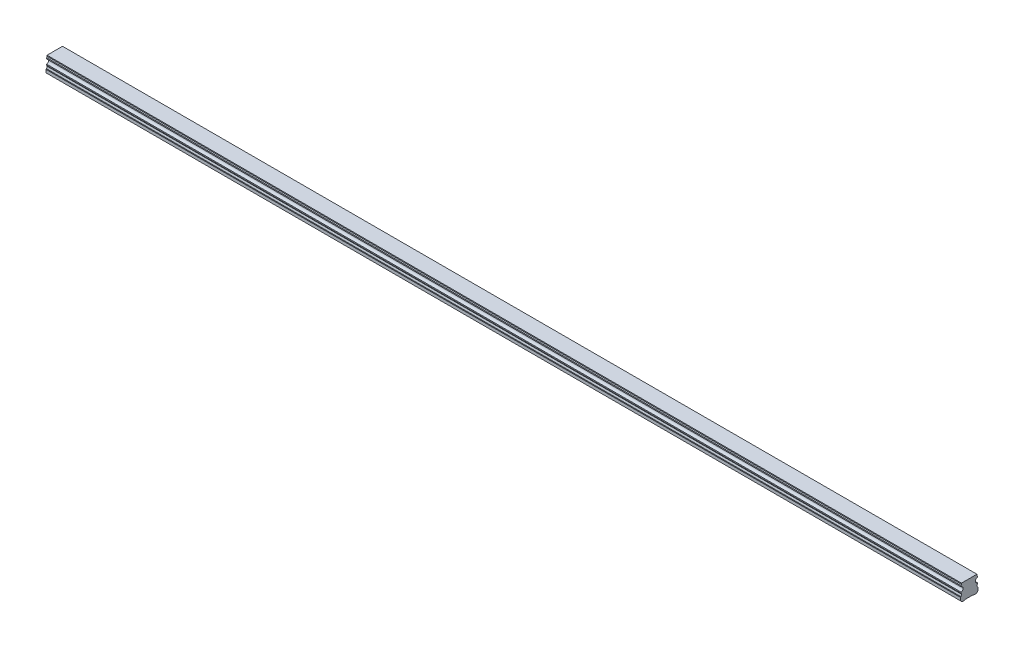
ISO-10303-21;
HEADER;
FILE_DESCRIPTION(('STEP AP214'),'2;1');
FILE_NAME('part.step','',(''),(''),'','','');
FILE_SCHEMA(('AUTOMOTIVE_DESIGN { 1 0 10303 214 1 1 1 1 }'));
ENDSEC;
DATA;
#1=APPLICATION_CONTEXT('core data for automotive mechanical design processes');
#2=APPLICATION_PROTOCOL_DEFINITION('international standard','automotive_design',2000,#1);
#3=PRODUCT_CONTEXT('',#1,'mechanical');
#4=PRODUCT('Part','Part','',(#3));
#5=PRODUCT_RELATED_PRODUCT_CATEGORY('part','',(#4));
#6=PRODUCT_DEFINITION_FORMATION('','',#4);
#7=PRODUCT_DEFINITION_CONTEXT('part definition',#1,'design');
#8=PRODUCT_DEFINITION('design','',#6,#7);
#9=PRODUCT_DEFINITION_SHAPE('','',#8);
#10=(LENGTH_UNIT() NAMED_UNIT(*) SI_UNIT(.MILLI.,.METRE.));
#11=(NAMED_UNIT(*) PLANE_ANGLE_UNIT() SI_UNIT($,.RADIAN.));
#12=(NAMED_UNIT(*) SI_UNIT($,.STERADIAN.) SOLID_ANGLE_UNIT());
#13=UNCERTAINTY_MEASURE_WITH_UNIT(LENGTH_MEASURE(1.E-05),#10,'distance_accuracy_value','');
#14=(GEOMETRIC_REPRESENTATION_CONTEXT(3) GLOBAL_UNCERTAINTY_ASSIGNED_CONTEXT((#13)) GLOBAL_UNIT_ASSIGNED_CONTEXT((#10,
#11,#12)) REPRESENTATION_CONTEXT('',''));
#15=CARTESIAN_POINT('',(0.,0.,0.));
#16=DIRECTION('',(0.,0.,1.));
#17=DIRECTION('',(1.,0.,0.));
#18=AXIS2_PLACEMENT_3D('',#15,#16,#17);
#19=CARTESIAN_POINT('',(750.,0.399999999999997,0.));
#20=DIRECTION('',(0.,-1.,0.));
#21=DIRECTION('',(0.,0.,-1.));
#22=AXIS2_PLACEMENT_3D('',#19,#20,#21);
#23=CONICAL_SURFACE('',#22,2.90000000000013,0.785398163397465);
#24=CARTESIAN_POINT('',(750.,0.800000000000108,0.));
#25=DIRECTION('',(0.,1.,0.));
#26=DIRECTION('',(0.,0.,1.));
#27=AXIS2_PLACEMENT_3D('',#24,#25,#26);
#28=CIRCLE('',#27,2.5);
#29=CARTESIAN_POINT('',(750.,0.80000000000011,2.5));
#30=VERTEX_POINT('',#29);
#31=EDGE_CURVE('E11',#30,#30,#28,.F.);
#32=ORIENTED_EDGE('',*,*,#31,.F.);
#33=EDGE_LOOP('',(#32));
#34=FACE_BOUND('',#33,.T.);
#35=CARTESIAN_POINT('',(750.,0.399999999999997,0.));
#36=DIRECTION('',(0.,1.,0.));
#37=DIRECTION('',(0.,0.,1.));
#38=AXIS2_PLACEMENT_3D('',#35,#36,#37);
#39=CIRCLE('',#38,2.90000000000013);
#40=CARTESIAN_POINT('',(750.,0.399999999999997,2.90000000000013));
#41=VERTEX_POINT('',#40);
#42=EDGE_CURVE('E553',#41,#41,#39,.T.);
#43=ORIENTED_EDGE('',*,*,#42,.F.);
#44=EDGE_LOOP('',(#43));
#45=FACE_BOUND('',#44,.T.);
#46=ADVANCED_FACE('F39',(#34,#45),#23,.F.);
#47=CARTESIAN_POINT('',(750.,7.,0.));
#48=DIRECTION('',(0.,-1.,0.));
#49=DIRECTION('',(0.,0.,-1.));
#50=AXIS2_PLACEMENT_3D('',#47,#48,#49);
#51=CYLINDRICAL_SURFACE('',#50,2.5);
#52=ORIENTED_EDGE('',*,*,#31,.T.);
#53=EDGE_LOOP('',(#52));
#54=FACE_BOUND('',#53,.T.);
#55=CARTESIAN_POINT('',(750.,7.,0.));
#56=DIRECTION('',(0.,-1.,0.));
#57=DIRECTION('',(0.,0.,-1.));
#58=AXIS2_PLACEMENT_3D('',#55,#56,#57);
#59=CIRCLE('',#58,2.5);
#60=CARTESIAN_POINT('',(750.,7.,-2.50000000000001));
#61=VERTEX_POINT('',#60);
#62=EDGE_CURVE('E49',#61,#61,#59,.T.);
#63=ORIENTED_EDGE('',*,*,#62,.F.);
#64=EDGE_LOOP('',(#63));
#65=FACE_BOUND('',#64,.T.);
#66=ADVANCED_FACE('F763',(#54,#65),#51,.F.);
#67=CARTESIAN_POINT('',(750.,7.,0.));
#68=DIRECTION('',(0.,-1.,0.));
#69=DIRECTION('',(0.,0.,-1.));
#70=AXIS2_PLACEMENT_3D('',#67,#68,#69);
#71=PLANE('',#70);
#72=CARTESIAN_POINT('',(750.,7.,0.));
#73=DIRECTION('',(0.,-1.,0.));
#74=DIRECTION('',(0.,0.,-1.));
#75=AXIS2_PLACEMENT_3D('',#72,#73,#74);
#76=CIRCLE('',#75,2.1);
#77=CARTESIAN_POINT('',(750.,7.,-2.1));
#78=VERTEX_POINT('',#77);
#79=EDGE_CURVE('E42',#78,#78,#76,.T.);
#80=ORIENTED_EDGE('',*,*,#79,.F.);
#81=EDGE_LOOP('',(#80));
#82=FACE_BOUND('',#81,.T.);
#83=ORIENTED_EDGE('',*,*,#62,.T.);
#84=EDGE_LOOP('',(#83));
#85=FACE_BOUND('',#84,.T.);
#86=ADVANCED_FACE('F768',(#82,#85),#71,.T.);
#87=CARTESIAN_POINT('',(690.,0.399999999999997,0.));
#88=DIRECTION('',(0.,-1.,0.));
#89=DIRECTION('',(0.,0.,-1.));
#90=AXIS2_PLACEMENT_3D('',#87,#88,#89);
#91=CONICAL_SURFACE('',#90,2.90000000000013,0.785398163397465);
#92=CARTESIAN_POINT('',(690.,0.800000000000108,0.));
#93=DIRECTION('',(0.,1.,0.));
#94=DIRECTION('',(0.,0.,1.));
#95=AXIS2_PLACEMENT_3D('',#92,#93,#94);
#96=CIRCLE('',#95,2.5);
#97=CARTESIAN_POINT('',(690.,0.80000000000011,2.5));
#98=VERTEX_POINT('',#97);
#99=EDGE_CURVE('E549',#98,#98,#96,.F.);
#100=ORIENTED_EDGE('',*,*,#99,.F.);
#101=EDGE_LOOP('',(#100));
#102=FACE_BOUND('',#101,.T.);
#103=CARTESIAN_POINT('',(690.,0.399999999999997,0.));
#104=DIRECTION('',(0.,1.,0.));
#105=DIRECTION('',(0.,0.,1.));
#106=AXIS2_PLACEMENT_3D('',#103,#104,#105);
#107=CIRCLE('',#106,2.90000000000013);
#108=CARTESIAN_POINT('',(690.,0.399999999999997,2.90000000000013));
#109=VERTEX_POINT('',#108);
#110=EDGE_CURVE('E541',#109,#109,#107,.T.);
#111=ORIENTED_EDGE('',*,*,#110,.F.);
#112=EDGE_LOOP('',(#111));
#113=FACE_BOUND('',#112,.T.);
#114=ADVANCED_FACE('F963',(#102,#113),#91,.F.);
#115=CARTESIAN_POINT('',(690.,7.,0.));
#116=DIRECTION('',(0.,-1.,0.));
#117=DIRECTION('',(0.,0.,-1.));
#118=AXIS2_PLACEMENT_3D('',#115,#116,#117);
#119=CYLINDRICAL_SURFACE('',#118,2.5);
#120=ORIENTED_EDGE('',*,*,#99,.T.);
#121=EDGE_LOOP('',(#120));
#122=FACE_BOUND('',#121,.T.);
#123=CARTESIAN_POINT('',(690.,7.,0.));
#124=DIRECTION('',(0.,-1.,0.));
#125=DIRECTION('',(0.,0.,-1.));
#126=AXIS2_PLACEMENT_3D('',#123,#124,#125);
#127=CIRCLE('',#126,2.5);
#128=CARTESIAN_POINT('',(690.,7.,-2.50000000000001));
#129=VERTEX_POINT('',#128);
#130=EDGE_CURVE('E545',#129,#129,#127,.T.);
#131=ORIENTED_EDGE('',*,*,#130,.F.);
#132=EDGE_LOOP('',(#131));
#133=FACE_BOUND('',#132,.T.);
#134=ADVANCED_FACE('F959',(#122,#133),#119,.F.);
#135=CARTESIAN_POINT('',(690.,7.,0.));
#136=DIRECTION('',(0.,-1.,0.));
#137=DIRECTION('',(0.,0.,-1.));
#138=AXIS2_PLACEMENT_3D('',#135,#136,#137);
#139=PLANE('',#138);
#140=CARTESIAN_POINT('',(690.,7.,0.));
#141=DIRECTION('',(0.,-1.,0.));
#142=DIRECTION('',(0.,0.,-1.));
#143=AXIS2_PLACEMENT_3D('',#140,#141,#142);
#144=CIRCLE('',#143,2.1);
#145=CARTESIAN_POINT('',(690.,7.,-2.1));
#146=VERTEX_POINT('',#145);
#147=EDGE_CURVE('E600',#146,#146,#144,.T.);
#148=ORIENTED_EDGE('',*,*,#147,.F.);
#149=EDGE_LOOP('',(#148));
#150=FACE_BOUND('',#149,.T.);
#151=ORIENTED_EDGE('',*,*,#130,.T.);
#152=EDGE_LOOP('',(#151));
#153=FACE_BOUND('',#152,.T.);
#154=ADVANCED_FACE('F955',(#150,#153),#139,.T.);
#155=CARTESIAN_POINT('',(630.,0.399999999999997,0.));
#156=DIRECTION('',(0.,-1.,0.));
#157=DIRECTION('',(0.,0.,-1.));
#158=AXIS2_PLACEMENT_3D('',#155,#156,#157);
#159=CONICAL_SURFACE('',#158,2.90000000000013,0.785398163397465);
#160=CARTESIAN_POINT('',(630.,0.800000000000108,0.));
#161=DIRECTION('',(0.,1.,0.));
#162=DIRECTION('',(0.,0.,1.));
#163=AXIS2_PLACEMENT_3D('',#160,#161,#162);
#164=CIRCLE('',#163,2.5);
#165=CARTESIAN_POINT('',(630.,0.80000000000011,2.5));
#166=VERTEX_POINT('',#165);
#167=EDGE_CURVE('E537',#166,#166,#164,.F.);
#168=ORIENTED_EDGE('',*,*,#167,.F.);
#169=EDGE_LOOP('',(#168));
#170=FACE_BOUND('',#169,.T.);
#171=CARTESIAN_POINT('',(630.,0.399999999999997,0.));
#172=DIRECTION('',(0.,1.,0.));
#173=DIRECTION('',(0.,0.,1.));
#174=AXIS2_PLACEMENT_3D('',#171,#172,#173);
#175=CIRCLE('',#174,2.90000000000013);
#176=CARTESIAN_POINT('',(630.,0.399999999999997,2.90000000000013));
#177=VERTEX_POINT('',#176);
#178=EDGE_CURVE('E529',#177,#177,#175,.T.);
#179=ORIENTED_EDGE('',*,*,#178,.F.);
#180=EDGE_LOOP('',(#179));
#181=FACE_BOUND('',#180,.T.);
#182=ADVANCED_FACE('F951',(#170,#181),#159,.F.);
#183=CARTESIAN_POINT('',(630.,7.,0.));
#184=DIRECTION('',(0.,-1.,0.));
#185=DIRECTION('',(0.,0.,-1.));
#186=AXIS2_PLACEMENT_3D('',#183,#184,#185);
#187=CYLINDRICAL_SURFACE('',#186,2.5);
#188=ORIENTED_EDGE('',*,*,#167,.T.);
#189=EDGE_LOOP('',(#188));
#190=FACE_BOUND('',#189,.T.);
#191=CARTESIAN_POINT('',(630.,7.,0.));
#192=DIRECTION('',(0.,-1.,0.));
#193=DIRECTION('',(0.,0.,-1.));
#194=AXIS2_PLACEMENT_3D('',#191,#192,#193);
#195=CIRCLE('',#194,2.5);
#196=CARTESIAN_POINT('',(630.,7.,-2.50000000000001));
#197=VERTEX_POINT('',#196);
#198=EDGE_CURVE('E533',#197,#197,#195,.T.);
#199=ORIENTED_EDGE('',*,*,#198,.F.);
#200=EDGE_LOOP('',(#199));
#201=FACE_BOUND('',#200,.T.);
#202=ADVANCED_FACE('F947',(#190,#201),#187,.F.);
#203=CARTESIAN_POINT('',(630.,7.,0.));
#204=DIRECTION('',(0.,-1.,0.));
#205=DIRECTION('',(0.,0.,-1.));
#206=AXIS2_PLACEMENT_3D('',#203,#204,#205);
#207=PLANE('',#206);
#208=CARTESIAN_POINT('',(630.,7.,0.));
#209=DIRECTION('',(0.,-1.,0.));
#210=DIRECTION('',(0.,0.,-1.));
#211=AXIS2_PLACEMENT_3D('',#208,#209,#210);
#212=CIRCLE('',#211,2.1);
#213=CARTESIAN_POINT('',(630.,7.,-2.1));
#214=VERTEX_POINT('',#213);
#215=EDGE_CURVE('E597',#214,#214,#212,.T.);
#216=ORIENTED_EDGE('',*,*,#215,.F.);
#217=EDGE_LOOP('',(#216));
#218=FACE_BOUND('',#217,.T.);
#219=ORIENTED_EDGE('',*,*,#198,.T.);
#220=EDGE_LOOP('',(#219));
#221=FACE_BOUND('',#220,.T.);
#222=ADVANCED_FACE('F943',(#218,#221),#207,.T.);
#223=CARTESIAN_POINT('',(570.,0.399999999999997,0.));
#224=DIRECTION('',(0.,-1.,0.));
#225=DIRECTION('',(0.,0.,-1.));
#226=AXIS2_PLACEMENT_3D('',#223,#224,#225);
#227=CONICAL_SURFACE('',#226,2.90000000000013,0.785398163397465);
#228=CARTESIAN_POINT('',(570.,0.800000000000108,0.));
#229=DIRECTION('',(0.,1.,0.));
#230=DIRECTION('',(0.,0.,1.));
#231=AXIS2_PLACEMENT_3D('',#228,#229,#230);
#232=CIRCLE('',#231,2.5);
#233=CARTESIAN_POINT('',(570.,0.80000000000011,2.5));
#234=VERTEX_POINT('',#233);
#235=EDGE_CURVE('E525',#234,#234,#232,.F.);
#236=ORIENTED_EDGE('',*,*,#235,.F.);
#237=EDGE_LOOP('',(#236));
#238=FACE_BOUND('',#237,.T.);
#239=CARTESIAN_POINT('',(570.,0.399999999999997,0.));
#240=DIRECTION('',(0.,1.,0.));
#241=DIRECTION('',(0.,0.,1.));
#242=AXIS2_PLACEMENT_3D('',#239,#240,#241);
#243=CIRCLE('',#242,2.90000000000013);
#244=CARTESIAN_POINT('',(570.,0.399999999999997,2.90000000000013));
#245=VERTEX_POINT('',#244);
#246=EDGE_CURVE('E517',#245,#245,#243,.T.);
#247=ORIENTED_EDGE('',*,*,#246,.F.);
#248=EDGE_LOOP('',(#247));
#249=FACE_BOUND('',#248,.T.);
#250=ADVANCED_FACE('F939',(#238,#249),#227,.F.);
#251=CARTESIAN_POINT('',(570.,7.,0.));
#252=DIRECTION('',(0.,-1.,0.));
#253=DIRECTION('',(0.,0.,-1.));
#254=AXIS2_PLACEMENT_3D('',#251,#252,#253);
#255=CYLINDRICAL_SURFACE('',#254,2.5);
#256=ORIENTED_EDGE('',*,*,#235,.T.);
#257=EDGE_LOOP('',(#256));
#258=FACE_BOUND('',#257,.T.);
#259=CARTESIAN_POINT('',(570.,7.,0.));
#260=DIRECTION('',(0.,-1.,0.));
#261=DIRECTION('',(0.,0.,-1.));
#262=AXIS2_PLACEMENT_3D('',#259,#260,#261);
#263=CIRCLE('',#262,2.5);
#264=CARTESIAN_POINT('',(570.,7.,-2.50000000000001));
#265=VERTEX_POINT('',#264);
#266=EDGE_CURVE('E521',#265,#265,#263,.T.);
#267=ORIENTED_EDGE('',*,*,#266,.F.);
#268=EDGE_LOOP('',(#267));
#269=FACE_BOUND('',#268,.T.);
#270=ADVANCED_FACE('F935',(#258,#269),#255,.F.);
#271=CARTESIAN_POINT('',(570.,7.,0.));
#272=DIRECTION('',(0.,-1.,0.));
#273=DIRECTION('',(0.,0.,-1.));
#274=AXIS2_PLACEMENT_3D('',#271,#272,#273);
#275=PLANE('',#274);
#276=CARTESIAN_POINT('',(570.,7.,0.));
#277=DIRECTION('',(0.,-1.,0.));
#278=DIRECTION('',(0.,0.,-1.));
#279=AXIS2_PLACEMENT_3D('',#276,#277,#278);
#280=CIRCLE('',#279,2.1);
#281=CARTESIAN_POINT('',(570.,7.,-2.1));
#282=VERTEX_POINT('',#281);
#283=EDGE_CURVE('E593',#282,#282,#280,.T.);
#284=ORIENTED_EDGE('',*,*,#283,.F.);
#285=EDGE_LOOP('',(#284));
#286=FACE_BOUND('',#285,.T.);
#287=ORIENTED_EDGE('',*,*,#266,.T.);
#288=EDGE_LOOP('',(#287));
#289=FACE_BOUND('',#288,.T.);
#290=ADVANCED_FACE('F931',(#286,#289),#275,.T.);
#291=CARTESIAN_POINT('',(510.,0.399999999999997,0.));
#292=DIRECTION('',(0.,-1.,0.));
#293=DIRECTION('',(0.,0.,-1.));
#294=AXIS2_PLACEMENT_3D('',#291,#292,#293);
#295=CONICAL_SURFACE('',#294,2.90000000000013,0.785398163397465);
#296=CARTESIAN_POINT('',(510.,0.800000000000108,0.));
#297=DIRECTION('',(0.,1.,0.));
#298=DIRECTION('',(0.,0.,1.));
#299=AXIS2_PLACEMENT_3D('',#296,#297,#298);
#300=CIRCLE('',#299,2.5);
#301=CARTESIAN_POINT('',(510.,0.80000000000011,2.5));
#302=VERTEX_POINT('',#301);
#303=EDGE_CURVE('E513',#302,#302,#300,.F.);
#304=ORIENTED_EDGE('',*,*,#303,.F.);
#305=EDGE_LOOP('',(#304));
#306=FACE_BOUND('',#305,.T.);
#307=CARTESIAN_POINT('',(510.,0.399999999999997,0.));
#308=DIRECTION('',(0.,1.,0.));
#309=DIRECTION('',(0.,0.,1.));
#310=AXIS2_PLACEMENT_3D('',#307,#308,#309);
#311=CIRCLE('',#310,2.90000000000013);
#312=CARTESIAN_POINT('',(510.,0.399999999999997,2.90000000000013));
#313=VERTEX_POINT('',#312);
#314=EDGE_CURVE('E505',#313,#313,#311,.T.);
#315=ORIENTED_EDGE('',*,*,#314,.F.);
#316=EDGE_LOOP('',(#315));
#317=FACE_BOUND('',#316,.T.);
#318=ADVANCED_FACE('F927',(#306,#317),#295,.F.);
#319=CARTESIAN_POINT('',(510.,7.,0.));
#320=DIRECTION('',(0.,-1.,0.));
#321=DIRECTION('',(0.,0.,-1.));
#322=AXIS2_PLACEMENT_3D('',#319,#320,#321);
#323=CYLINDRICAL_SURFACE('',#322,2.5);
#324=ORIENTED_EDGE('',*,*,#303,.T.);
#325=EDGE_LOOP('',(#324));
#326=FACE_BOUND('',#325,.T.);
#327=CARTESIAN_POINT('',(510.,7.,0.));
#328=DIRECTION('',(0.,-1.,0.));
#329=DIRECTION('',(0.,0.,-1.));
#330=AXIS2_PLACEMENT_3D('',#327,#328,#329);
#331=CIRCLE('',#330,2.5);
#332=CARTESIAN_POINT('',(510.,7.,-2.50000000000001));
#333=VERTEX_POINT('',#332);
#334=EDGE_CURVE('E509',#333,#333,#331,.T.);
#335=ORIENTED_EDGE('',*,*,#334,.F.);
#336=EDGE_LOOP('',(#335));
#337=FACE_BOUND('',#336,.T.);
#338=ADVANCED_FACE('F923',(#326,#337),#323,.F.);
#339=CARTESIAN_POINT('',(510.,7.,0.));
#340=DIRECTION('',(0.,-1.,0.));
#341=DIRECTION('',(0.,0.,-1.));
#342=AXIS2_PLACEMENT_3D('',#339,#340,#341);
#343=PLANE('',#342);
#344=CARTESIAN_POINT('',(510.,7.,0.));
#345=DIRECTION('',(0.,-1.,0.));
#346=DIRECTION('',(0.,0.,-1.));
#347=AXIS2_PLACEMENT_3D('',#344,#345,#346);
#348=CIRCLE('',#347,2.1);
#349=CARTESIAN_POINT('',(510.,7.,-2.1));
#350=VERTEX_POINT('',#349);
#351=EDGE_CURVE('E589',#350,#350,#348,.T.);
#352=ORIENTED_EDGE('',*,*,#351,.F.);
#353=EDGE_LOOP('',(#352));
#354=FACE_BOUND('',#353,.T.);
#355=ORIENTED_EDGE('',*,*,#334,.T.);
#356=EDGE_LOOP('',(#355));
#357=FACE_BOUND('',#356,.T.);
#358=ADVANCED_FACE('F919',(#354,#357),#343,.T.);
#359=CARTESIAN_POINT('',(450.,0.399999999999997,0.));
#360=DIRECTION('',(0.,-1.,0.));
#361=DIRECTION('',(0.,0.,-1.));
#362=AXIS2_PLACEMENT_3D('',#359,#360,#361);
#363=CONICAL_SURFACE('',#362,2.90000000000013,0.785398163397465);
#364=CARTESIAN_POINT('',(450.,0.800000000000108,0.));
#365=DIRECTION('',(0.,1.,0.));
#366=DIRECTION('',(0.,0.,1.));
#367=AXIS2_PLACEMENT_3D('',#364,#365,#366);
#368=CIRCLE('',#367,2.5);
#369=CARTESIAN_POINT('',(450.,0.80000000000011,2.5));
#370=VERTEX_POINT('',#369);
#371=EDGE_CURVE('E501',#370,#370,#368,.F.);
#372=ORIENTED_EDGE('',*,*,#371,.F.);
#373=EDGE_LOOP('',(#372));
#374=FACE_BOUND('',#373,.T.);
#375=CARTESIAN_POINT('',(450.,0.399999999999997,0.));
#376=DIRECTION('',(0.,1.,0.));
#377=DIRECTION('',(0.,0.,1.));
#378=AXIS2_PLACEMENT_3D('',#375,#376,#377);
#379=CIRCLE('',#378,2.90000000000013);
#380=CARTESIAN_POINT('',(450.,0.399999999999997,2.90000000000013));
#381=VERTEX_POINT('',#380);
#382=EDGE_CURVE('E493',#381,#381,#379,.T.);
#383=ORIENTED_EDGE('',*,*,#382,.F.);
#384=EDGE_LOOP('',(#383));
#385=FACE_BOUND('',#384,.T.);
#386=ADVANCED_FACE('F915',(#374,#385),#363,.F.);
#387=CARTESIAN_POINT('',(450.,7.,0.));
#388=DIRECTION('',(0.,-1.,0.));
#389=DIRECTION('',(0.,0.,-1.));
#390=AXIS2_PLACEMENT_3D('',#387,#388,#389);
#391=CYLINDRICAL_SURFACE('',#390,2.5);
#392=ORIENTED_EDGE('',*,*,#371,.T.);
#393=EDGE_LOOP('',(#392));
#394=FACE_BOUND('',#393,.T.);
#395=CARTESIAN_POINT('',(450.,7.,0.));
#396=DIRECTION('',(0.,-1.,0.));
#397=DIRECTION('',(0.,0.,-1.));
#398=AXIS2_PLACEMENT_3D('',#395,#396,#397);
#399=CIRCLE('',#398,2.5);
#400=CARTESIAN_POINT('',(450.,7.,-2.50000000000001));
#401=VERTEX_POINT('',#400);
#402=EDGE_CURVE('E497',#401,#401,#399,.T.);
#403=ORIENTED_EDGE('',*,*,#402,.F.);
#404=EDGE_LOOP('',(#403));
#405=FACE_BOUND('',#404,.T.);
#406=ADVANCED_FACE('F911',(#394,#405),#391,.F.);
#407=CARTESIAN_POINT('',(450.,7.,0.));
#408=DIRECTION('',(0.,-1.,0.));
#409=DIRECTION('',(0.,0.,-1.));
#410=AXIS2_PLACEMENT_3D('',#407,#408,#409);
#411=PLANE('',#410);
#412=CARTESIAN_POINT('',(450.,7.,0.));
#413=DIRECTION('',(0.,-1.,0.));
#414=DIRECTION('',(0.,0.,-1.));
#415=AXIS2_PLACEMENT_3D('',#412,#413,#414);
#416=CIRCLE('',#415,2.1);
#417=CARTESIAN_POINT('',(450.,7.,-2.1));
#418=VERTEX_POINT('',#417);
#419=EDGE_CURVE('E585',#418,#418,#416,.T.);
#420=ORIENTED_EDGE('',*,*,#419,.F.);
#421=EDGE_LOOP('',(#420));
#422=FACE_BOUND('',#421,.T.);
#423=ORIENTED_EDGE('',*,*,#402,.T.);
#424=EDGE_LOOP('',(#423));
#425=FACE_BOUND('',#424,.T.);
#426=ADVANCED_FACE('F907',(#422,#425),#411,.T.);
#427=CARTESIAN_POINT('',(390.,0.399999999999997,0.));
#428=DIRECTION('',(0.,-1.,0.));
#429=DIRECTION('',(0.,0.,-1.));
#430=AXIS2_PLACEMENT_3D('',#427,#428,#429);
#431=CONICAL_SURFACE('',#430,2.90000000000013,0.785398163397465);
#432=CARTESIAN_POINT('',(390.,0.800000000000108,0.));
#433=DIRECTION('',(0.,1.,0.));
#434=DIRECTION('',(0.,0.,1.));
#435=AXIS2_PLACEMENT_3D('',#432,#433,#434);
#436=CIRCLE('',#435,2.5);
#437=CARTESIAN_POINT('',(390.,0.80000000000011,2.5));
#438=VERTEX_POINT('',#437);
#439=EDGE_CURVE('E489',#438,#438,#436,.F.);
#440=ORIENTED_EDGE('',*,*,#439,.F.);
#441=EDGE_LOOP('',(#440));
#442=FACE_BOUND('',#441,.T.);
#443=CARTESIAN_POINT('',(390.,0.399999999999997,0.));
#444=DIRECTION('',(0.,1.,0.));
#445=DIRECTION('',(0.,0.,1.));
#446=AXIS2_PLACEMENT_3D('',#443,#444,#445);
#447=CIRCLE('',#446,2.90000000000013);
#448=CARTESIAN_POINT('',(390.,0.399999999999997,2.90000000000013));
#449=VERTEX_POINT('',#448);
#450=EDGE_CURVE('E481',#449,#449,#447,.T.);
#451=ORIENTED_EDGE('',*,*,#450,.F.);
#452=EDGE_LOOP('',(#451));
#453=FACE_BOUND('',#452,.T.);
#454=ADVANCED_FACE('F903',(#442,#453),#431,.F.);
#455=CARTESIAN_POINT('',(390.,7.,0.));
#456=DIRECTION('',(0.,-1.,0.));
#457=DIRECTION('',(0.,0.,-1.));
#458=AXIS2_PLACEMENT_3D('',#455,#456,#457);
#459=CYLINDRICAL_SURFACE('',#458,2.5);
#460=ORIENTED_EDGE('',*,*,#439,.T.);
#461=EDGE_LOOP('',(#460));
#462=FACE_BOUND('',#461,.T.);
#463=CARTESIAN_POINT('',(390.,7.,0.));
#464=DIRECTION('',(0.,-1.,0.));
#465=DIRECTION('',(0.,0.,-1.));
#466=AXIS2_PLACEMENT_3D('',#463,#464,#465);
#467=CIRCLE('',#466,2.5);
#468=CARTESIAN_POINT('',(390.,7.,-2.50000000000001));
#469=VERTEX_POINT('',#468);
#470=EDGE_CURVE('E485',#469,#469,#467,.T.);
#471=ORIENTED_EDGE('',*,*,#470,.F.);
#472=EDGE_LOOP('',(#471));
#473=FACE_BOUND('',#472,.T.);
#474=ADVANCED_FACE('F899',(#462,#473),#459,.F.);
#475=CARTESIAN_POINT('',(390.,7.,0.));
#476=DIRECTION('',(0.,-1.,0.));
#477=DIRECTION('',(0.,0.,-1.));
#478=AXIS2_PLACEMENT_3D('',#475,#476,#477);
#479=PLANE('',#478);
#480=CARTESIAN_POINT('',(390.,7.,0.));
#481=DIRECTION('',(0.,-1.,0.));
#482=DIRECTION('',(0.,0.,-1.));
#483=AXIS2_PLACEMENT_3D('',#480,#481,#482);
#484=CIRCLE('',#483,2.1);
#485=CARTESIAN_POINT('',(390.,7.,-2.1));
#486=VERTEX_POINT('',#485);
#487=EDGE_CURVE('E581',#486,#486,#484,.T.);
#488=ORIENTED_EDGE('',*,*,#487,.F.);
#489=EDGE_LOOP('',(#488));
#490=FACE_BOUND('',#489,.T.);
#491=ORIENTED_EDGE('',*,*,#470,.T.);
#492=EDGE_LOOP('',(#491));
#493=FACE_BOUND('',#492,.T.);
#494=ADVANCED_FACE('F895',(#490,#493),#479,.T.);
#495=CARTESIAN_POINT('',(330.,0.399999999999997,0.));
#496=DIRECTION('',(0.,-1.,0.));
#497=DIRECTION('',(0.,0.,-1.));
#498=AXIS2_PLACEMENT_3D('',#495,#496,#497);
#499=CONICAL_SURFACE('',#498,2.90000000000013,0.785398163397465);
#500=CARTESIAN_POINT('',(330.,0.800000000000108,0.));
#501=DIRECTION('',(0.,1.,0.));
#502=DIRECTION('',(0.,0.,1.));
#503=AXIS2_PLACEMENT_3D('',#500,#501,#502);
#504=CIRCLE('',#503,2.5);
#505=CARTESIAN_POINT('',(330.,0.80000000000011,2.5));
#506=VERTEX_POINT('',#505);
#507=EDGE_CURVE('E477',#506,#506,#504,.F.);
#508=ORIENTED_EDGE('',*,*,#507,.F.);
#509=EDGE_LOOP('',(#508));
#510=FACE_BOUND('',#509,.T.);
#511=CARTESIAN_POINT('',(330.,0.399999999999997,0.));
#512=DIRECTION('',(0.,1.,0.));
#513=DIRECTION('',(0.,0.,1.));
#514=AXIS2_PLACEMENT_3D('',#511,#512,#513);
#515=CIRCLE('',#514,2.90000000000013);
#516=CARTESIAN_POINT('',(330.,0.399999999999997,2.90000000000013));
#517=VERTEX_POINT('',#516);
#518=EDGE_CURVE('E469',#517,#517,#515,.T.);
#519=ORIENTED_EDGE('',*,*,#518,.F.);
#520=EDGE_LOOP('',(#519));
#521=FACE_BOUND('',#520,.T.);
#522=ADVANCED_FACE('F891',(#510,#521),#499,.F.);
#523=CARTESIAN_POINT('',(330.,7.,0.));
#524=DIRECTION('',(0.,-1.,0.));
#525=DIRECTION('',(0.,0.,-1.));
#526=AXIS2_PLACEMENT_3D('',#523,#524,#525);
#527=CYLINDRICAL_SURFACE('',#526,2.5);
#528=ORIENTED_EDGE('',*,*,#507,.T.);
#529=EDGE_LOOP('',(#528));
#530=FACE_BOUND('',#529,.T.);
#531=CARTESIAN_POINT('',(330.,7.,0.));
#532=DIRECTION('',(0.,-1.,0.));
#533=DIRECTION('',(0.,0.,-1.));
#534=AXIS2_PLACEMENT_3D('',#531,#532,#533);
#535=CIRCLE('',#534,2.5);
#536=CARTESIAN_POINT('',(330.,7.,-2.50000000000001));
#537=VERTEX_POINT('',#536);
#538=EDGE_CURVE('E473',#537,#537,#535,.T.);
#539=ORIENTED_EDGE('',*,*,#538,.F.);
#540=EDGE_LOOP('',(#539));
#541=FACE_BOUND('',#540,.T.);
#542=ADVANCED_FACE('F887',(#530,#541),#527,.F.);
#543=CARTESIAN_POINT('',(330.,7.,0.));
#544=DIRECTION('',(0.,-1.,0.));
#545=DIRECTION('',(0.,0.,-1.));
#546=AXIS2_PLACEMENT_3D('',#543,#544,#545);
#547=PLANE('',#546);
#548=CARTESIAN_POINT('',(330.,7.,0.));
#549=DIRECTION('',(0.,-1.,0.));
#550=DIRECTION('',(0.,0.,-1.));
#551=AXIS2_PLACEMENT_3D('',#548,#549,#550);
#552=CIRCLE('',#551,2.1);
#553=CARTESIAN_POINT('',(330.,7.,-2.1));
#554=VERTEX_POINT('',#553);
#555=EDGE_CURVE('E577',#554,#554,#552,.T.);
#556=ORIENTED_EDGE('',*,*,#555,.F.);
#557=EDGE_LOOP('',(#556));
#558=FACE_BOUND('',#557,.T.);
#559=ORIENTED_EDGE('',*,*,#538,.T.);
#560=EDGE_LOOP('',(#559));
#561=FACE_BOUND('',#560,.T.);
#562=ADVANCED_FACE('F883',(#558,#561),#547,.T.);
#563=CARTESIAN_POINT('',(270.,0.399999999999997,0.));
#564=DIRECTION('',(0.,-1.,0.));
#565=DIRECTION('',(0.,0.,-1.));
#566=AXIS2_PLACEMENT_3D('',#563,#564,#565);
#567=CONICAL_SURFACE('',#566,2.90000000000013,0.785398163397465);
#568=CARTESIAN_POINT('',(270.,0.800000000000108,0.));
#569=DIRECTION('',(0.,1.,0.));
#570=DIRECTION('',(0.,0.,1.));
#571=AXIS2_PLACEMENT_3D('',#568,#569,#570);
#572=CIRCLE('',#571,2.5);
#573=CARTESIAN_POINT('',(270.,0.80000000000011,2.5));
#574=VERTEX_POINT('',#573);
#575=EDGE_CURVE('E465',#574,#574,#572,.F.);
#576=ORIENTED_EDGE('',*,*,#575,.F.);
#577=EDGE_LOOP('',(#576));
#578=FACE_BOUND('',#577,.T.);
#579=CARTESIAN_POINT('',(270.,0.399999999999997,0.));
#580=DIRECTION('',(0.,1.,0.));
#581=DIRECTION('',(0.,0.,1.));
#582=AXIS2_PLACEMENT_3D('',#579,#580,#581);
#583=CIRCLE('',#582,2.90000000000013);
#584=CARTESIAN_POINT('',(270.,0.399999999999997,2.90000000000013));
#585=VERTEX_POINT('',#584);
#586=EDGE_CURVE('E457',#585,#585,#583,.T.);
#587=ORIENTED_EDGE('',*,*,#586,.F.);
#588=EDGE_LOOP('',(#587));
#589=FACE_BOUND('',#588,.T.);
#590=ADVANCED_FACE('F879',(#578,#589),#567,.F.);
#591=CARTESIAN_POINT('',(270.,7.,0.));
#592=DIRECTION('',(0.,-1.,0.));
#593=DIRECTION('',(0.,0.,-1.));
#594=AXIS2_PLACEMENT_3D('',#591,#592,#593);
#595=CYLINDRICAL_SURFACE('',#594,2.5);
#596=ORIENTED_EDGE('',*,*,#575,.T.);
#597=EDGE_LOOP('',(#596));
#598=FACE_BOUND('',#597,.T.);
#599=CARTESIAN_POINT('',(270.,7.,0.));
#600=DIRECTION('',(0.,-1.,0.));
#601=DIRECTION('',(0.,0.,-1.));
#602=AXIS2_PLACEMENT_3D('',#599,#600,#601);
#603=CIRCLE('',#602,2.5);
#604=CARTESIAN_POINT('',(270.,7.,-2.50000000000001));
#605=VERTEX_POINT('',#604);
#606=EDGE_CURVE('E461',#605,#605,#603,.T.);
#607=ORIENTED_EDGE('',*,*,#606,.F.);
#608=EDGE_LOOP('',(#607));
#609=FACE_BOUND('',#608,.T.);
#610=ADVANCED_FACE('F875',(#598,#609),#595,.F.);
#611=CARTESIAN_POINT('',(270.,7.,0.));
#612=DIRECTION('',(0.,-1.,0.));
#613=DIRECTION('',(0.,0.,-1.));
#614=AXIS2_PLACEMENT_3D('',#611,#612,#613);
#615=PLANE('',#614);
#616=CARTESIAN_POINT('',(270.,7.,0.));
#617=DIRECTION('',(0.,-1.,0.));
#618=DIRECTION('',(0.,0.,-1.));
#619=AXIS2_PLACEMENT_3D('',#616,#617,#618);
#620=CIRCLE('',#619,2.1);
#621=CARTESIAN_POINT('',(270.,7.,-2.1));
#622=VERTEX_POINT('',#621);
#623=EDGE_CURVE('E573',#622,#622,#620,.T.);
#624=ORIENTED_EDGE('',*,*,#623,.F.);
#625=EDGE_LOOP('',(#624));
#626=FACE_BOUND('',#625,.T.);
#627=ORIENTED_EDGE('',*,*,#606,.T.);
#628=EDGE_LOOP('',(#627));
#629=FACE_BOUND('',#628,.T.);
#630=ADVANCED_FACE('F871',(#626,#629),#615,.T.);
#631=CARTESIAN_POINT('',(210.,0.399999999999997,0.));
#632=DIRECTION('',(0.,-1.,0.));
#633=DIRECTION('',(0.,0.,-1.));
#634=AXIS2_PLACEMENT_3D('',#631,#632,#633);
#635=CONICAL_SURFACE('',#634,2.90000000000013,0.785398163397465);
#636=CARTESIAN_POINT('',(210.,0.800000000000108,0.));
#637=DIRECTION('',(0.,1.,0.));
#638=DIRECTION('',(0.,0.,1.));
#639=AXIS2_PLACEMENT_3D('',#636,#637,#638);
#640=CIRCLE('',#639,2.5);
#641=CARTESIAN_POINT('',(210.,0.80000000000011,2.5));
#642=VERTEX_POINT('',#641);
#643=EDGE_CURVE('E453',#642,#642,#640,.F.);
#644=ORIENTED_EDGE('',*,*,#643,.F.);
#645=EDGE_LOOP('',(#644));
#646=FACE_BOUND('',#645,.T.);
#647=CARTESIAN_POINT('',(210.,0.399999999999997,0.));
#648=DIRECTION('',(0.,1.,0.));
#649=DIRECTION('',(0.,0.,1.));
#650=AXIS2_PLACEMENT_3D('',#647,#648,#649);
#651=CIRCLE('',#650,2.90000000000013);
#652=CARTESIAN_POINT('',(210.,0.399999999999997,2.90000000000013));
#653=VERTEX_POINT('',#652);
#654=EDGE_CURVE('E445',#653,#653,#651,.T.);
#655=ORIENTED_EDGE('',*,*,#654,.F.);
#656=EDGE_LOOP('',(#655));
#657=FACE_BOUND('',#656,.T.);
#658=ADVANCED_FACE('F867',(#646,#657),#635,.F.);
#659=CARTESIAN_POINT('',(210.,7.,0.));
#660=DIRECTION('',(0.,-1.,0.));
#661=DIRECTION('',(0.,0.,-1.));
#662=AXIS2_PLACEMENT_3D('',#659,#660,#661);
#663=CYLINDRICAL_SURFACE('',#662,2.5);
#664=ORIENTED_EDGE('',*,*,#643,.T.);
#665=EDGE_LOOP('',(#664));
#666=FACE_BOUND('',#665,.T.);
#667=CARTESIAN_POINT('',(210.,7.,0.));
#668=DIRECTION('',(0.,-1.,0.));
#669=DIRECTION('',(0.,0.,-1.));
#670=AXIS2_PLACEMENT_3D('',#667,#668,#669);
#671=CIRCLE('',#670,2.5);
#672=CARTESIAN_POINT('',(210.,7.,-2.50000000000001));
#673=VERTEX_POINT('',#672);
#674=EDGE_CURVE('E449',#673,#673,#671,.T.);
#675=ORIENTED_EDGE('',*,*,#674,.F.);
#676=EDGE_LOOP('',(#675));
#677=FACE_BOUND('',#676,.T.);
#678=ADVANCED_FACE('F863',(#666,#677),#663,.F.);
#679=CARTESIAN_POINT('',(210.,7.,0.));
#680=DIRECTION('',(0.,-1.,0.));
#681=DIRECTION('',(0.,0.,-1.));
#682=AXIS2_PLACEMENT_3D('',#679,#680,#681);
#683=PLANE('',#682);
#684=CARTESIAN_POINT('',(210.,7.,0.));
#685=DIRECTION('',(0.,-1.,0.));
#686=DIRECTION('',(0.,0.,-1.));
#687=AXIS2_PLACEMENT_3D('',#684,#685,#686);
#688=CIRCLE('',#687,2.1);
#689=CARTESIAN_POINT('',(210.,7.,-2.1));
#690=VERTEX_POINT('',#689);
#691=EDGE_CURVE('E569',#690,#690,#688,.T.);
#692=ORIENTED_EDGE('',*,*,#691,.F.);
#693=EDGE_LOOP('',(#692));
#694=FACE_BOUND('',#693,.T.);
#695=ORIENTED_EDGE('',*,*,#674,.T.);
#696=EDGE_LOOP('',(#695));
#697=FACE_BOUND('',#696,.T.);
#698=ADVANCED_FACE('F859',(#694,#697),#683,.T.);
#699=CARTESIAN_POINT('',(150.,0.399999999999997,0.));
#700=DIRECTION('',(0.,-1.,0.));
#701=DIRECTION('',(0.,0.,-1.));
#702=AXIS2_PLACEMENT_3D('',#699,#700,#701);
#703=CONICAL_SURFACE('',#702,2.90000000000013,0.785398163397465);
#704=CARTESIAN_POINT('',(150.,0.800000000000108,0.));
#705=DIRECTION('',(0.,1.,0.));
#706=DIRECTION('',(0.,0.,1.));
#707=AXIS2_PLACEMENT_3D('',#704,#705,#706);
#708=CIRCLE('',#707,2.5);
#709=CARTESIAN_POINT('',(150.,0.80000000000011,2.5));
#710=VERTEX_POINT('',#709);
#711=EDGE_CURVE('E441',#710,#710,#708,.F.);
#712=ORIENTED_EDGE('',*,*,#711,.F.);
#713=EDGE_LOOP('',(#712));
#714=FACE_BOUND('',#713,.T.);
#715=CARTESIAN_POINT('',(150.,0.399999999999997,0.));
#716=DIRECTION('',(0.,1.,0.));
#717=DIRECTION('',(0.,0.,1.));
#718=AXIS2_PLACEMENT_3D('',#715,#716,#717);
#719=CIRCLE('',#718,2.90000000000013);
#720=CARTESIAN_POINT('',(150.,0.399999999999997,2.90000000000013));
#721=VERTEX_POINT('',#720);
#722=EDGE_CURVE('E433',#721,#721,#719,.T.);
#723=ORIENTED_EDGE('',*,*,#722,.F.);
#724=EDGE_LOOP('',(#723));
#725=FACE_BOUND('',#724,.T.);
#726=ADVANCED_FACE('F855',(#714,#725),#703,.F.);
#727=CARTESIAN_POINT('',(150.,7.,0.));
#728=DIRECTION('',(0.,-1.,0.));
#729=DIRECTION('',(0.,0.,-1.));
#730=AXIS2_PLACEMENT_3D('',#727,#728,#729);
#731=CYLINDRICAL_SURFACE('',#730,2.5);
#732=ORIENTED_EDGE('',*,*,#711,.T.);
#733=EDGE_LOOP('',(#732));
#734=FACE_BOUND('',#733,.T.);
#735=CARTESIAN_POINT('',(150.,7.,0.));
#736=DIRECTION('',(0.,-1.,0.));
#737=DIRECTION('',(0.,0.,-1.));
#738=AXIS2_PLACEMENT_3D('',#735,#736,#737);
#739=CIRCLE('',#738,2.5);
#740=CARTESIAN_POINT('',(150.,7.,-2.50000000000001));
#741=VERTEX_POINT('',#740);
#742=EDGE_CURVE('E437',#741,#741,#739,.T.);
#743=ORIENTED_EDGE('',*,*,#742,.F.);
#744=EDGE_LOOP('',(#743));
#745=FACE_BOUND('',#744,.T.);
#746=ADVANCED_FACE('F851',(#734,#745),#731,.F.);
#747=CARTESIAN_POINT('',(150.,7.,0.));
#748=DIRECTION('',(0.,-1.,0.));
#749=DIRECTION('',(0.,0.,-1.));
#750=AXIS2_PLACEMENT_3D('',#747,#748,#749);
#751=PLANE('',#750);
#752=CARTESIAN_POINT('',(150.,7.,0.));
#753=DIRECTION('',(0.,-1.,0.));
#754=DIRECTION('',(0.,0.,-1.));
#755=AXIS2_PLACEMENT_3D('',#752,#753,#754);
#756=CIRCLE('',#755,2.1);
#757=CARTESIAN_POINT('',(150.,7.,-2.1));
#758=VERTEX_POINT('',#757);
#759=EDGE_CURVE('E564',#758,#758,#756,.T.);
#760=ORIENTED_EDGE('',*,*,#759,.F.);
#761=EDGE_LOOP('',(#760));
#762=FACE_BOUND('',#761,.T.);
#763=ORIENTED_EDGE('',*,*,#742,.T.);
#764=EDGE_LOOP('',(#763));
#765=FACE_BOUND('',#764,.T.);
#766=ADVANCED_FACE('F841',(#762,#765),#751,.T.);
#767=CARTESIAN_POINT('',(780.,14.,-6.59000000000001));
#768=DIRECTION('',(0.,0.,1.));
#769=DIRECTION('',(0.,-1.,0.));
#770=AXIS2_PLACEMENT_3D('',#767,#768,#769);
#771=PLANE('',#770);
#772=DIRECTION('',(0.,1.,0.));
#773=VECTOR('',#772,1.);
#774=CARTESIAN_POINT('',(0.,14.,-6.59000000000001));
#775=LINE('',#774,#773);
#776=CARTESIAN_POINT('',(0.,13.15,-6.59));
#777=VERTEX_POINT('',#776);
#778=CARTESIAN_POINT('',(0.,14.,-6.59000000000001));
#779=VERTEX_POINT('',#778);
#780=EDGE_CURVE('E255',#777,#779,#775,.T.);
#781=ORIENTED_EDGE('',*,*,#780,.T.);
#782=DIRECTION('',(-1.,0.,0.));
#783=VECTOR('',#782,1.);
#784=CARTESIAN_POINT('',(780.,14.,-6.59000000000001));
#785=LINE('',#784,#783);
#786=CARTESIAN_POINT('',(780.,14.,-6.59000000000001));
#787=VERTEX_POINT('',#786);
#788=EDGE_CURVE('E422',#787,#779,#785,.T.);
#789=ORIENTED_EDGE('',*,*,#788,.F.);
#790=DIRECTION('',(0.,1.,0.));
#791=VECTOR('',#790,1.);
#792=CARTESIAN_POINT('',(780.,14.,-6.59000000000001));
#793=LINE('',#792,#791);
#794=CARTESIAN_POINT('',(780.,13.15,-6.59));
#795=VERTEX_POINT('',#794);
#796=EDGE_CURVE('E332',#795,#787,#793,.T.);
#797=ORIENTED_EDGE('',*,*,#796,.F.);
#798=DIRECTION('',(-1.,0.,0.));
#799=VECTOR('',#798,1.);
#800=CARTESIAN_POINT('',(780.,13.15,-6.59));
#801=LINE('',#800,#799);
#802=EDGE_CURVE('E251',#795,#777,#801,.T.);
#803=ORIENTED_EDGE('',*,*,#802,.T.);
#804=EDGE_LOOP('',(#781,#789,#797,#803));
#805=FACE_BOUND('',#804,.T.);
#806=ADVANCED_FACE('F838',(#805),#771,.F.);
#807=CARTESIAN_POINT('',(780.,14.,-6.59000000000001));
#808=DIRECTION('',(0.,-1.,0.));
#809=DIRECTION('',(0.,0.,-1.));
#810=AXIS2_PLACEMENT_3D('',#807,#808,#809);
#811=PLANE('',#810);
#812=DIRECTION('',(0.,0.,1.));
#813=VECTOR('',#812,1.);
#814=CARTESIAN_POINT('',(0.,14.,-6.59000000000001));
#815=LINE('',#814,#813);
#816=CARTESIAN_POINT('',(0.,14.,6.59));
#817=VERTEX_POINT('',#816);
#818=EDGE_CURVE('E259',#779,#817,#815,.T.);
#819=ORIENTED_EDGE('',*,*,#818,.T.);
#820=DIRECTION('',(-1.,0.,0.));
#821=VECTOR('',#820,1.);
#822=CARTESIAN_POINT('',(780.,14.,6.59));
#823=LINE('',#822,#821);
#824=CARTESIAN_POINT('',(780.,14.,6.59));
#825=VERTEX_POINT('',#824);
#826=EDGE_CURVE('E418',#825,#817,#823,.T.);
#827=ORIENTED_EDGE('',*,*,#826,.F.);
#828=DIRECTION('',(0.,0.,1.));
#829=VECTOR('',#828,1.);
#830=CARTESIAN_POINT('',(780.,14.,-6.59000000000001));
#831=LINE('',#830,#829);
#832=EDGE_CURVE('E157',#787,#825,#831,.T.);
#833=ORIENTED_EDGE('',*,*,#832,.F.);
#834=ORIENTED_EDGE('',*,*,#788,.T.);
#835=EDGE_LOOP('',(#819,#827,#833,#834));
#836=FACE_BOUND('',#835,.T.);
#837=ADVANCED_FACE('F834',(#836),#811,.F.);
#838=CARTESIAN_POINT('',(780.,14.,6.59));
#839=DIRECTION('',(0.,0.,-1.));
#840=DIRECTION('',(0.,1.,0.));
#841=AXIS2_PLACEMENT_3D('',#838,#839,#840);
#842=PLANE('',#841);
#843=DIRECTION('',(0.,-1.,0.));
#844=VECTOR('',#843,1.);
#845=CARTESIAN_POINT('',(0.,14.,6.59));
#846=LINE('',#845,#844);
#847=CARTESIAN_POINT('',(0.,13.15,6.59));
#848=VERTEX_POINT('',#847);
#849=EDGE_CURVE('E263',#817,#848,#846,.T.);
#850=ORIENTED_EDGE('',*,*,#849,.T.);
#851=DIRECTION('',(-1.,0.,0.));
#852=VECTOR('',#851,1.);
#853=CARTESIAN_POINT('',(780.,13.15,6.59));
#854=LINE('',#853,#852);
#855=CARTESIAN_POINT('',(780.,13.15,6.59));
#856=VERTEX_POINT('',#855);
#857=EDGE_CURVE('E414',#856,#848,#854,.T.);
#858=ORIENTED_EDGE('',*,*,#857,.F.);
#859=DIRECTION('',(0.,-1.,0.));
#860=VECTOR('',#859,1.);
#861=CARTESIAN_POINT('',(780.,14.,6.59));
#862=LINE('',#861,#860);
#863=EDGE_CURVE('E642',#825,#856,#862,.T.);
#864=ORIENTED_EDGE('',*,*,#863,.F.);
#865=ORIENTED_EDGE('',*,*,#826,.T.);
#866=EDGE_LOOP('',(#850,#858,#864,#865));
#867=FACE_BOUND('',#866,.T.);
#868=ADVANCED_FACE('F830',(#867),#842,.F.);
#869=CARTESIAN_POINT('',(780.,13.15,6.59));
#870=DIRECTION('',(0.,-0.422618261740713,-0.906307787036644));
#871=DIRECTION('',(0.,0.906307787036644,-0.422618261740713));
#872=AXIS2_PLACEMENT_3D('',#869,#870,#871);
#873=PLANE('',#872);
#874=DIRECTION('',(0.,-0.906307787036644,0.422618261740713));
#875=VECTOR('',#874,1.);
#876=CARTESIAN_POINT('',(0.,13.15,6.59));
#877=LINE('',#876,#875);
#878=CARTESIAN_POINT('',(0.,12.3565324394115,6.96));
#879=VERTEX_POINT('',#878);
#880=EDGE_CURVE('E266',#848,#879,#877,.T.);
#881=ORIENTED_EDGE('',*,*,#880,.T.);
#882=DIRECTION('',(-1.,0.,0.));
#883=VECTOR('',#882,1.);
#884=CARTESIAN_POINT('',(780.,12.3565324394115,6.96));
#885=LINE('',#884,#883);
#886=CARTESIAN_POINT('',(780.,12.3565324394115,6.96));
#887=VERTEX_POINT('',#886);
#888=EDGE_CURVE('E410',#887,#879,#885,.T.);
#889=ORIENTED_EDGE('',*,*,#888,.F.);
#890=DIRECTION('',(0.,-0.906307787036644,0.422618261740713));
#891=VECTOR('',#890,1.);
#892=CARTESIAN_POINT('',(780.,13.15,6.59));
#893=LINE('',#892,#891);
#894=EDGE_CURVE('E645',#856,#887,#893,.T.);
#895=ORIENTED_EDGE('',*,*,#894,.F.);
#896=ORIENTED_EDGE('',*,*,#857,.T.);
#897=EDGE_LOOP('',(#881,#889,#895,#896));
#898=FACE_BOUND('',#897,.T.);
#899=ADVANCED_FACE('F826',(#898),#873,.F.);
#900=CARTESIAN_POINT('',(780.,12.3565324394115,6.96));
#901=DIRECTION('',(0.,0.,-1.));
#902=DIRECTION('',(0.,1.,0.));
#903=AXIS2_PLACEMENT_3D('',#900,#901,#902);
#904=PLANE('',#903);
#905=DIRECTION('',(0.,-1.,0.));
#906=VECTOR('',#905,1.);
#907=CARTESIAN_POINT('',(0.,12.3565324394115,6.96));
#908=LINE('',#907,#906);
#909=CARTESIAN_POINT('',(0.,11.4351744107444,6.96));
#910=VERTEX_POINT('',#909);
#911=EDGE_CURVE('E269',#879,#910,#908,.T.);
#912=ORIENTED_EDGE('',*,*,#911,.T.);
#913=DIRECTION('',(-1.,0.,0.));
#914=VECTOR('',#913,1.);
#915=CARTESIAN_POINT('',(780.,11.4351744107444,6.96));
#916=LINE('',#915,#914);
#917=CARTESIAN_POINT('',(780.,11.4351744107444,6.96));
#918=VERTEX_POINT('',#917);
#919=EDGE_CURVE('E406',#918,#910,#916,.T.);
#920=ORIENTED_EDGE('',*,*,#919,.F.);
#921=DIRECTION('',(0.,-1.,0.));
#922=VECTOR('',#921,1.);
#923=CARTESIAN_POINT('',(780.,12.3565324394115,6.96));
#924=LINE('',#923,#922);
#925=EDGE_CURVE('E648',#887,#918,#924,.T.);
#926=ORIENTED_EDGE('',*,*,#925,.F.);
#927=ORIENTED_EDGE('',*,*,#888,.T.);
#928=EDGE_LOOP('',(#912,#920,#926,#927));
#929=FACE_BOUND('',#928,.T.);
#930=ADVANCED_FACE('F822',(#929),#904,.F.);
#931=CARTESIAN_POINT('',(780.,9.5,7.2));
#932=DIRECTION('',(-1.,0.,0.));
#933=DIRECTION('',(0.,0.,1.));
#934=AXIS2_PLACEMENT_3D('',#931,#932,#933);
#935=CYLINDRICAL_SURFACE('',#934,1.95);
#936=CARTESIAN_POINT('',(0.,9.5,7.2));
#937=DIRECTION('',(-1.,0.,0.));
#938=DIRECTION('',(0.,0.,-1.));
#939=AXIS2_PLACEMENT_3D('',#936,#937,#938);
#940=CIRCLE('',#939,1.95);
#941=CARTESIAN_POINT('',(0.,7.56482558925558,6.96));
#942=VERTEX_POINT('',#941);
#943=EDGE_CURVE('E272',#910,#942,#940,.T.);
#944=ORIENTED_EDGE('',*,*,#943,.T.);
#945=DIRECTION('',(-1.,0.,0.));
#946=VECTOR('',#945,1.);
#947=CARTESIAN_POINT('',(780.,7.56482558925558,6.96));
#948=LINE('',#947,#946);
#949=CARTESIAN_POINT('',(780.,7.56482558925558,6.96));
#950=VERTEX_POINT('',#949);
#951=EDGE_CURVE('E402',#950,#942,#948,.T.);
#952=ORIENTED_EDGE('',*,*,#951,.F.);
#953=CARTESIAN_POINT('',(780.,9.5,7.2));
#954=DIRECTION('',(-1.,0.,0.));
#955=DIRECTION('',(0.,0.,-1.));
#956=AXIS2_PLACEMENT_3D('',#953,#954,#955);
#957=CIRCLE('',#956,1.95);
#958=EDGE_CURVE('E651',#918,#950,#957,.T.);
#959=ORIENTED_EDGE('',*,*,#958,.F.);
#960=ORIENTED_EDGE('',*,*,#919,.T.);
#961=EDGE_LOOP('',(#944,#952,#959,#960));
#962=FACE_BOUND('',#961,.T.);
#963=ADVANCED_FACE('F818',(#962),#935,.F.);
#964=CARTESIAN_POINT('',(780.,7.56482558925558,6.96));
#965=DIRECTION('',(0.,0.,-1.));
#966=DIRECTION('',(0.,1.,0.));
#967=AXIS2_PLACEMENT_3D('',#964,#965,#966);
#968=PLANE('',#967);
#969=DIRECTION('',(0.,-1.,0.));
#970=VECTOR('',#969,1.);
#971=CARTESIAN_POINT('',(0.,7.56482558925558,6.96));
#972=LINE('',#971,#970);
#973=CARTESIAN_POINT('',(0.,6.64346756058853,6.96));
#974=VERTEX_POINT('',#973);
#975=EDGE_CURVE('E275',#942,#974,#972,.T.);
#976=ORIENTED_EDGE('',*,*,#975,.T.);
#977=DIRECTION('',(-1.,0.,0.));
#978=VECTOR('',#977,1.);
#979=CARTESIAN_POINT('',(780.,6.64346756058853,6.96));
#980=LINE('',#979,#978);
#981=CARTESIAN_POINT('',(780.,6.64346756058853,6.96));
#982=VERTEX_POINT('',#981);
#983=EDGE_CURVE('E398',#982,#974,#980,.T.);
#984=ORIENTED_EDGE('',*,*,#983,.F.);
#985=DIRECTION('',(0.,-1.,0.));
#986=VECTOR('',#985,1.);
#987=CARTESIAN_POINT('',(780.,7.56482558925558,6.96));
#988=LINE('',#987,#986);
#989=EDGE_CURVE('E654',#950,#982,#988,.T.);
#990=ORIENTED_EDGE('',*,*,#989,.F.);
#991=ORIENTED_EDGE('',*,*,#951,.T.);
#992=EDGE_LOOP('',(#976,#984,#990,#991));
#993=FACE_BOUND('',#992,.T.);
#994=ADVANCED_FACE('F814',(#993),#968,.F.);
#995=CARTESIAN_POINT('',(780.,6.64346756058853,6.96));
#996=DIRECTION('',(0.,0.422618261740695,-0.906307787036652));
#997=DIRECTION('',(0.,0.906307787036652,0.422618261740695));
#998=AXIS2_PLACEMENT_3D('',#995,#996,#997);
#999=PLANE('',#998);
#1000=DIRECTION('',(0.,-0.906307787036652,-0.422618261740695));
#1001=VECTOR('',#1000,1.);
#1002=CARTESIAN_POINT('',(0.,6.64346756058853,6.96));
#1003=LINE('',#1002,#1001);
#1004=CARTESIAN_POINT('',(0.,5.85,6.59000000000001));
#1005=VERTEX_POINT('',#1004);
#1006=EDGE_CURVE('E278',#974,#1005,#1003,.T.);
#1007=ORIENTED_EDGE('',*,*,#1006,.T.);
#1008=DIRECTION('',(-1.,0.,0.));
#1009=VECTOR('',#1008,1.);
#1010=CARTESIAN_POINT('',(780.,5.85,6.59000000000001));
#1011=LINE('',#1010,#1009);
#1012=CARTESIAN_POINT('',(780.,5.85,6.59000000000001));
#1013=VERTEX_POINT('',#1012);
#1014=EDGE_CURVE('E394',#1013,#1005,#1011,.T.);
#1015=ORIENTED_EDGE('',*,*,#1014,.F.);
#1016=DIRECTION('',(0.,-0.906307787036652,-0.422618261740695));
#1017=VECTOR('',#1016,1.);
#1018=CARTESIAN_POINT('',(780.,6.64346756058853,6.96));
#1019=LINE('',#1018,#1017);
#1020=EDGE_CURVE('E657',#982,#1013,#1019,.T.);
#1021=ORIENTED_EDGE('',*,*,#1020,.F.);
#1022=ORIENTED_EDGE('',*,*,#983,.T.);
#1023=EDGE_LOOP('',(#1007,#1015,#1021,#1022));
#1024=FACE_BOUND('',#1023,.T.);
#1025=ADVANCED_FACE('F810',(#1024),#999,.F.);
#1026=CARTESIAN_POINT('',(780.,5.85,6.59000000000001));
#1027=DIRECTION('',(0.,-0.25881904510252,-0.965925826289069));
#1028=DIRECTION('',(0.,0.965925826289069,-0.25881904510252));
#1029=AXIS2_PLACEMENT_3D('',#1026,#1027,#1028);
#1030=PLANE('',#1029);
#1031=DIRECTION('',(0.,-0.965925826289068,0.25881904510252));
#1032=VECTOR('',#1031,1.);
#1033=CARTESIAN_POINT('',(0.,5.85,6.59000000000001));
#1034=LINE('',#1033,#1032);
#1035=CARTESIAN_POINT('',(0.,4.2,7.03211616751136));
#1036=VERTEX_POINT('',#1035);
#1037=EDGE_CURVE('E281',#1005,#1036,#1034,.T.);
#1038=ORIENTED_EDGE('',*,*,#1037,.T.);
#1039=DIRECTION('',(-1.,0.,0.));
#1040=VECTOR('',#1039,1.);
#1041=CARTESIAN_POINT('',(780.,4.2,7.03211616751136));
#1042=LINE('',#1041,#1040);
#1043=CARTESIAN_POINT('',(780.,4.2,7.03211616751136));
#1044=VERTEX_POINT('',#1043);
#1045=EDGE_CURVE('E390',#1044,#1036,#1042,.T.);
#1046=ORIENTED_EDGE('',*,*,#1045,.F.);
#1047=DIRECTION('',(0.,-0.965925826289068,0.25881904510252));
#1048=VECTOR('',#1047,1.);
#1049=CARTESIAN_POINT('',(780.,5.85,6.59000000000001));
#1050=LINE('',#1049,#1048);
#1051=EDGE_CURVE('E660',#1013,#1044,#1050,.T.);
#1052=ORIENTED_EDGE('',*,*,#1051,.F.);
#1053=ORIENTED_EDGE('',*,*,#1014,.T.);
#1054=EDGE_LOOP('',(#1038,#1046,#1052,#1053));
#1055=FACE_BOUND('',#1054,.T.);
#1056=ADVANCED_FACE('F806',(#1055),#1030,.F.);
#1057=CARTESIAN_POINT('',(780.,4.2,7.03211616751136));
#1058=DIRECTION('',(0.,-0.866025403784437,-0.500000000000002));
#1059=DIRECTION('',(0.,0.500000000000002,-0.866025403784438));
#1060=AXIS2_PLACEMENT_3D('',#1057,#1058,#1059);
#1061=PLANE('',#1060);
#1062=DIRECTION('',(0.,-0.500000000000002,0.866025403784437));
#1063=VECTOR('',#1062,1.);
#1064=CARTESIAN_POINT('',(0.,4.2,7.03211616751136));
#1065=LINE('',#1064,#1063);
#1066=CARTESIAN_POINT('',(0.,3.92986714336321,7.5));
#1067=VERTEX_POINT('',#1066);
#1068=EDGE_CURVE('E284',#1036,#1067,#1065,.T.);
#1069=ORIENTED_EDGE('',*,*,#1068,.T.);
#1070=DIRECTION('',(-1.,0.,0.));
#1071=VECTOR('',#1070,1.);
#1072=CARTESIAN_POINT('',(780.,3.92986714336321,7.5));
#1073=LINE('',#1072,#1071);
#1074=CARTESIAN_POINT('',(780.,3.92986714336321,7.5));
#1075=VERTEX_POINT('',#1074);
#1076=EDGE_CURVE('E386',#1075,#1067,#1073,.T.);
#1077=ORIENTED_EDGE('',*,*,#1076,.F.);
#1078=DIRECTION('',(0.,-0.500000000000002,0.866025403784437));
#1079=VECTOR('',#1078,1.);
#1080=CARTESIAN_POINT('',(780.,4.2,7.03211616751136));
#1081=LINE('',#1080,#1079);
#1082=EDGE_CURVE('E663',#1044,#1075,#1081,.T.);
#1083=ORIENTED_EDGE('',*,*,#1082,.F.);
#1084=ORIENTED_EDGE('',*,*,#1045,.T.);
#1085=EDGE_LOOP('',(#1069,#1077,#1083,#1084));
#1086=FACE_BOUND('',#1085,.T.);
#1087=ADVANCED_FACE('F802',(#1086),#1061,.F.);
#1088=CARTESIAN_POINT('',(780.,3.92986714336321,7.5));
#1089=DIRECTION('',(0.,0.,-1.));
#1090=DIRECTION('',(0.,1.,0.));
#1091=AXIS2_PLACEMENT_3D('',#1088,#1089,#1090);
#1092=PLANE('',#1091);
#1093=DIRECTION('',(0.,-1.,0.));
#1094=VECTOR('',#1093,1.);
#1095=CARTESIAN_POINT('',(0.,3.92986714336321,7.5));
#1096=LINE('',#1095,#1094);
#1097=CARTESIAN_POINT('',(0.,1.4,7.5));
#1098=VERTEX_POINT('',#1097);
#1099=EDGE_CURVE('E287',#1067,#1098,#1096,.T.);
#1100=ORIENTED_EDGE('',*,*,#1099,.T.);
#1101=DIRECTION('',(-1.,0.,0.));
#1102=VECTOR('',#1101,1.);
#1103=CARTESIAN_POINT('',(780.,1.4,7.5));
#1104=LINE('',#1103,#1102);
#1105=CARTESIAN_POINT('',(780.,1.4,7.5));
#1106=VERTEX_POINT('',#1105);
#1107=EDGE_CURVE('E382',#1106,#1098,#1104,.T.);
#1108=ORIENTED_EDGE('',*,*,#1107,.F.);
#1109=DIRECTION('',(0.,-1.,0.));
#1110=VECTOR('',#1109,1.);
#1111=CARTESIAN_POINT('',(780.,3.92986714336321,7.5));
#1112=LINE('',#1111,#1110);
#1113=EDGE_CURVE('E666',#1075,#1106,#1112,.T.);
#1114=ORIENTED_EDGE('',*,*,#1113,.F.);
#1115=ORIENTED_EDGE('',*,*,#1076,.T.);
#1116=EDGE_LOOP('',(#1100,#1108,#1114,#1115));
#1117=FACE_BOUND('',#1116,.T.);
#1118=ADVANCED_FACE('F798',(#1117),#1092,.F.);
#1119=CARTESIAN_POINT('',(780.,1.4,7.5));
#1120=DIRECTION('',(0.,0.70710678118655,-0.707106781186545));
#1121=DIRECTION('',(0.,0.707106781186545,0.70710678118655));
#1122=AXIS2_PLACEMENT_3D('',#1119,#1120,#1121);
#1123=PLANE('',#1122);
#1124=DIRECTION('',(0.,-0.707106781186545,-0.70710678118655));
#1125=VECTOR('',#1124,1.);
#1126=CARTESIAN_POINT('',(0.,1.4,7.5));
#1127=LINE('',#1126,#1125);
#1128=CARTESIAN_POINT('',(0.,0.,6.1));
#1129=VERTEX_POINT('',#1128);
#1130=EDGE_CURVE('E290',#1098,#1129,#1127,.T.);
#1131=ORIENTED_EDGE('',*,*,#1130,.T.);
#1132=DIRECTION('',(-1.,0.,0.));
#1133=VECTOR('',#1132,1.);
#1134=CARTESIAN_POINT('',(780.,0.,6.1));
#1135=LINE('',#1134,#1133);
#1136=CARTESIAN_POINT('',(780.,0.,6.1));
#1137=VERTEX_POINT('',#1136);
#1138=EDGE_CURVE('E379',#1137,#1129,#1135,.T.);
#1139=ORIENTED_EDGE('',*,*,#1138,.F.);
#1140=DIRECTION('',(0.,-0.707106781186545,-0.70710678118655));
#1141=VECTOR('',#1140,1.);
#1142=CARTESIAN_POINT('',(780.,1.4,7.5));
#1143=LINE('',#1142,#1141);
#1144=EDGE_CURVE('E669',#1106,#1137,#1143,.T.);
#1145=ORIENTED_EDGE('',*,*,#1144,.F.);
#1146=ORIENTED_EDGE('',*,*,#1107,.T.);
#1147=EDGE_LOOP('',(#1131,#1139,#1145,#1146));
#1148=FACE_BOUND('',#1147,.T.);
#1149=ADVANCED_FACE('F794',(#1148),#1123,.F.);
#1150=CARTESIAN_POINT('',(780.,0.,6.1));
#1151=DIRECTION('',(0.,1.,0.));
#1152=DIRECTION('',(0.,0.,1.));
#1153=AXIS2_PLACEMENT_3D('',#1150,#1151,#1152);
#1154=PLANE('',#1153);
#1155=DIRECTION('',(0.,0.,-1.));
#1156=VECTOR('',#1155,1.);
#1157=CARTESIAN_POINT('',(0.,0.,6.1));
#1158=LINE('',#1157,#1156);
#1159=CARTESIAN_POINT('',(0.,0.,3.65));
#1160=VERTEX_POINT('',#1159);
#1161=EDGE_CURVE('E293',#1129,#1160,#1158,.T.);
#1162=ORIENTED_EDGE('',*,*,#1161,.T.);
#1163=DIRECTION('',(-1.,0.,0.));
#1164=VECTOR('',#1163,1.);
#1165=CARTESIAN_POINT('',(780.,0.,3.65));
#1166=LINE('',#1165,#1164);
#1167=CARTESIAN_POINT('',(780.,0.,3.65));
#1168=VERTEX_POINT('',#1167);
#1169=EDGE_CURVE('E375',#1168,#1160,#1166,.T.);
#1170=ORIENTED_EDGE('',*,*,#1169,.F.);
#1171=DIRECTION('',(0.,0.,-1.));
#1172=VECTOR('',#1171,1.);
#1173=CARTESIAN_POINT('',(780.,0.,6.1));
#1174=LINE('',#1173,#1172);
#1175=EDGE_CURVE('E672',#1137,#1168,#1174,.T.);
#1176=ORIENTED_EDGE('',*,*,#1175,.F.);
#1177=ORIENTED_EDGE('',*,*,#1138,.T.);
#1178=EDGE_LOOP('',(#1162,#1170,#1176,#1177));
#1179=FACE_BOUND('',#1178,.T.);
#1180=ADVANCED_FACE('F786',(#1179),#1154,.F.);
#1181=CARTESIAN_POINT('',(780.,0.,3.65));
#1182=DIRECTION('',(0.,0.707106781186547,0.707106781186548));
#1183=DIRECTION('',(0.,-0.707106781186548,0.707106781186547));
#1184=AXIS2_PLACEMENT_3D('',#1181,#1182,#1183);
#1185=PLANE('',#1184);
#1186=DIRECTION('',(0.,0.707106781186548,-0.707106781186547));
#1187=VECTOR('',#1186,1.);
#1188=CARTESIAN_POINT('',(0.,0.,3.65));
#1189=LINE('',#1188,#1187);
#1190=CARTESIAN_POINT('',(0.,0.399999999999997,3.25));
#1191=VERTEX_POINT('',#1190);
#1192=EDGE_CURVE('E296',#1160,#1191,#1189,.T.);
#1193=ORIENTED_EDGE('',*,*,#1192,.T.);
#1194=DIRECTION('',(-1.,0.,0.));
#1195=VECTOR('',#1194,1.);
#1196=CARTESIAN_POINT('',(780.,0.399999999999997,3.25));
#1197=LINE('',#1196,#1195);
#1198=CARTESIAN_POINT('',(780.,0.399999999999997,3.25));
#1199=VERTEX_POINT('',#1198);
#1200=EDGE_CURVE('E371',#1199,#1191,#1197,.T.);
#1201=ORIENTED_EDGE('',*,*,#1200,.F.);
#1202=DIRECTION('',(0.,0.707106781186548,-0.707106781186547));
#1203=VECTOR('',#1202,1.);
#1204=CARTESIAN_POINT('',(780.,0.,3.65));
#1205=LINE('',#1204,#1203);
#1206=EDGE_CURVE('E675',#1168,#1199,#1205,.T.);
#1207=ORIENTED_EDGE('',*,*,#1206,.F.);
#1208=ORIENTED_EDGE('',*,*,#1169,.T.);
#1209=EDGE_LOOP('',(#1193,#1201,#1207,#1208));
#1210=FACE_BOUND('',#1209,.T.);
#1211=ADVANCED_FACE('F777',(#1210),#1185,.F.);
#1212=CARTESIAN_POINT('',(780.,0.399999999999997,3.25));
#1213=DIRECTION('',(0.,1.,0.));
#1214=DIRECTION('',(0.,0.,1.));
#1215=AXIS2_PLACEMENT_3D('',#1212,#1213,#1214);
#1216=PLANE('',#1215);
#1217=CARTESIAN_POINT('',(90.,0.399999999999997,0.));
#1218=DIRECTION('',(0.,1.,0.));
#1219=DIRECTION('',(0.,0.,1.));
#1220=AXIS2_PLACEMENT_3D('',#1217,#1218,#1219);
#1221=CIRCLE('',#1220,2.90000000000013);
#1222=CARTESIAN_POINT('',(90.,0.399999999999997,2.90000000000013));
#1223=VERTEX_POINT('',#1222);
#1224=EDGE_CURVE('E608',#1223,#1223,#1221,.T.);
#1225=ORIENTED_EDGE('',*,*,#1224,.T.);
#1226=EDGE_LOOP('',(#1225));
#1227=FACE_BOUND('',#1226,.T.);
#1228=CARTESIAN_POINT('',(30.,0.399999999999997,0.));
#1229=DIRECTION('',(0.,1.,0.));
#1230=DIRECTION('',(0.,0.,1.));
#1231=AXIS2_PLACEMENT_3D('',#1228,#1229,#1230);
#1232=CIRCLE('',#1231,2.90000000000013);
#1233=CARTESIAN_POINT('',(30.,0.399999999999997,2.90000000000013));
#1234=VERTEX_POINT('',#1233);
#1235=EDGE_CURVE('E425',#1234,#1234,#1232,.T.);
#1236=ORIENTED_EDGE('',*,*,#1235,.T.);
#1237=EDGE_LOOP('',(#1236));
#1238=FACE_BOUND('',#1237,.T.);
#1239=DIRECTION('',(0.,0.,-1.));
#1240=VECTOR('',#1239,1.);
#1241=CARTESIAN_POINT('',(0.,0.399999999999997,3.25));
#1242=LINE('',#1241,#1240);
#1243=CARTESIAN_POINT('',(0.,0.399999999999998,-3.25));
#1244=VERTEX_POINT('',#1243);
#1245=EDGE_CURVE('E299',#1191,#1244,#1242,.T.);
#1246=ORIENTED_EDGE('',*,*,#1245,.T.);
#1247=DIRECTION('',(-1.,0.,0.));
#1248=VECTOR('',#1247,1.);
#1249=CARTESIAN_POINT('',(780.,0.399999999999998,-3.25));
#1250=LINE('',#1249,#1248);
#1251=CARTESIAN_POINT('',(780.,0.399999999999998,-3.25));
#1252=VERTEX_POINT('',#1251);
#1253=EDGE_CURVE('E367',#1252,#1244,#1250,.T.);
#1254=ORIENTED_EDGE('',*,*,#1253,.F.);
#1255=DIRECTION('',(0.,0.,-1.));
#1256=VECTOR('',#1255,1.);
#1257=CARTESIAN_POINT('',(780.,0.399999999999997,3.25));
#1258=LINE('',#1257,#1256);
#1259=EDGE_CURVE('E678',#1199,#1252,#1258,.T.);
#1260=ORIENTED_EDGE('',*,*,#1259,.F.);
#1261=ORIENTED_EDGE('',*,*,#1200,.T.);
#1262=EDGE_LOOP('',(#1246,#1254,#1260,#1261));
#1263=FACE_BOUND('',#1262,.T.);
#1264=ORIENTED_EDGE('',*,*,#722,.T.);
#1265=EDGE_LOOP('',(#1264));
#1266=FACE_BOUND('',#1265,.T.);
#1267=ORIENTED_EDGE('',*,*,#654,.T.);
#1268=EDGE_LOOP('',(#1267));
#1269=FACE_BOUND('',#1268,.T.);
#1270=ORIENTED_EDGE('',*,*,#586,.T.);
#1271=EDGE_LOOP('',(#1270));
#1272=FACE_BOUND('',#1271,.T.);
#1273=ORIENTED_EDGE('',*,*,#518,.T.);
#1274=EDGE_LOOP('',(#1273));
#1275=FACE_BOUND('',#1274,.T.);
#1276=ORIENTED_EDGE('',*,*,#450,.T.);
#1277=EDGE_LOOP('',(#1276));
#1278=FACE_BOUND('',#1277,.T.);
#1279=ORIENTED_EDGE('',*,*,#382,.T.);
#1280=EDGE_LOOP('',(#1279));
#1281=FACE_BOUND('',#1280,.T.);
#1282=ORIENTED_EDGE('',*,*,#314,.T.);
#1283=EDGE_LOOP('',(#1282));
#1284=FACE_BOUND('',#1283,.T.);
#1285=ORIENTED_EDGE('',*,*,#246,.T.);
#1286=EDGE_LOOP('',(#1285));
#1287=FACE_BOUND('',#1286,.T.);
#1288=ORIENTED_EDGE('',*,*,#178,.T.);
#1289=EDGE_LOOP('',(#1288));
#1290=FACE_BOUND('',#1289,.T.);
#1291=ORIENTED_EDGE('',*,*,#110,.T.);
#1292=EDGE_LOOP('',(#1291));
#1293=FACE_BOUND('',#1292,.T.);
#1294=ORIENTED_EDGE('',*,*,#42,.T.);
#1295=EDGE_LOOP('',(#1294));
#1296=FACE_BOUND('',#1295,.T.);
#1297=ADVANCED_FACE('F774',(#1227,#1238,#1263,#1266,#1269,#1272,#1275,#1278,#1281,#1284,#1287,
#1290,#1293,#1296),#1216,.F.);
#1298=CARTESIAN_POINT('',(780.,0.399999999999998,-3.25));
#1299=DIRECTION('',(0.,0.707106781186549,-0.707106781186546));
#1300=DIRECTION('',(0.,0.707106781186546,0.707106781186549));
#1301=AXIS2_PLACEMENT_3D('',#1298,#1299,#1300);
#1302=PLANE('',#1301);
#1303=DIRECTION('',(0.,-0.707106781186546,-0.707106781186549));
#1304=VECTOR('',#1303,1.);
#1305=CARTESIAN_POINT('',(0.,0.399999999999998,-3.25));
#1306=LINE('',#1305,#1304);
#1307=CARTESIAN_POINT('',(0.,0.,-3.65));
#1308=VERTEX_POINT('',#1307);
#1309=EDGE_CURVE('E302',#1244,#1308,#1306,.T.);
#1310=ORIENTED_EDGE('',*,*,#1309,.T.);
#1311=DIRECTION('',(-1.,0.,0.));
#1312=VECTOR('',#1311,1.);
#1313=CARTESIAN_POINT('',(780.,0.,-3.65));
#1314=LINE('',#1313,#1312);
#1315=CARTESIAN_POINT('',(780.,0.,-3.65));
#1316=VERTEX_POINT('',#1315);
#1317=EDGE_CURVE('E363',#1316,#1308,#1314,.T.);
#1318=ORIENTED_EDGE('',*,*,#1317,.F.);
#1319=DIRECTION('',(0.,-0.707106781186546,-0.707106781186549));
#1320=VECTOR('',#1319,1.);
#1321=CARTESIAN_POINT('',(780.,0.399999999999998,-3.25));
#1322=LINE('',#1321,#1320);
#1323=EDGE_CURVE('E681',#1252,#1316,#1322,.T.);
#1324=ORIENTED_EDGE('',*,*,#1323,.F.);
#1325=ORIENTED_EDGE('',*,*,#1253,.T.);
#1326=EDGE_LOOP('',(#1310,#1318,#1324,#1325));
#1327=FACE_BOUND('',#1326,.T.);
#1328=ADVANCED_FACE('F776',(#1327),#1302,.F.);
#1329=CARTESIAN_POINT('',(780.,0.,-3.65));
#1330=DIRECTION('',(0.,1.,0.));
#1331=DIRECTION('',(0.,0.,1.));
#1332=AXIS2_PLACEMENT_3D('',#1329,#1330,#1331);
#1333=PLANE('',#1332);
#1334=DIRECTION('',(0.,0.,-1.));
#1335=VECTOR('',#1334,1.);
#1336=CARTESIAN_POINT('',(0.,0.,-3.65));
#1337=LINE('',#1336,#1335);
#1338=CARTESIAN_POINT('',(0.,0.,-6.1));
#1339=VERTEX_POINT('',#1338);
#1340=EDGE_CURVE('E305',#1308,#1339,#1337,.T.);
#1341=ORIENTED_EDGE('',*,*,#1340,.T.);
#1342=DIRECTION('',(-1.,0.,0.));
#1343=VECTOR('',#1342,1.);
#1344=CARTESIAN_POINT('',(780.,0.,-6.1));
#1345=LINE('',#1344,#1343);
#1346=CARTESIAN_POINT('',(780.,0.,-6.1));
#1347=VERTEX_POINT('',#1346);
#1348=EDGE_CURVE('E359',#1347,#1339,#1345,.T.);
#1349=ORIENTED_EDGE('',*,*,#1348,.F.);
#1350=DIRECTION('',(0.,0.,-1.));
#1351=VECTOR('',#1350,1.);
#1352=CARTESIAN_POINT('',(780.,0.,-3.65));
#1353=LINE('',#1352,#1351);
#1354=EDGE_CURVE('E684',#1316,#1347,#1353,.T.);
#1355=ORIENTED_EDGE('',*,*,#1354,.F.);
#1356=ORIENTED_EDGE('',*,*,#1317,.T.);
#1357=EDGE_LOOP('',(#1341,#1349,#1355,#1356));
#1358=FACE_BOUND('',#1357,.T.);
#1359=ADVANCED_FACE('F783',(#1358),#1333,.F.);
#1360=CARTESIAN_POINT('',(780.,0.,-6.1));
#1361=DIRECTION('',(0.,0.707106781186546,0.707106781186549));
#1362=DIRECTION('',(0.,-0.707106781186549,0.707106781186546));
#1363=AXIS2_PLACEMENT_3D('',#1360,#1361,#1362);
#1364=PLANE('',#1363);
#1365=DIRECTION('',(0.,0.707106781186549,-0.707106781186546));
#1366=VECTOR('',#1365,1.);
#1367=CARTESIAN_POINT('',(0.,0.,-6.1));
#1368=LINE('',#1367,#1366);
#1369=CARTESIAN_POINT('',(0.,1.4,-7.5));
#1370=VERTEX_POINT('',#1369);
#1371=EDGE_CURVE('E308',#1339,#1370,#1368,.T.);
#1372=ORIENTED_EDGE('',*,*,#1371,.T.);
#1373=DIRECTION('',(-1.,0.,0.));
#1374=VECTOR('',#1373,1.);
#1375=CARTESIAN_POINT('',(780.,1.4,-7.5));
#1376=LINE('',#1375,#1374);
#1377=CARTESIAN_POINT('',(780.,1.4,-7.5));
#1378=VERTEX_POINT('',#1377);
#1379=EDGE_CURVE('E355',#1378,#1370,#1376,.T.);
#1380=ORIENTED_EDGE('',*,*,#1379,.F.);
#1381=DIRECTION('',(0.,0.707106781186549,-0.707106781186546));
#1382=VECTOR('',#1381,1.);
#1383=CARTESIAN_POINT('',(780.,0.,-6.1));
#1384=LINE('',#1383,#1382);
#1385=EDGE_CURVE('E687',#1347,#1378,#1384,.T.);
#1386=ORIENTED_EDGE('',*,*,#1385,.F.);
#1387=ORIENTED_EDGE('',*,*,#1348,.T.);
#1388=EDGE_LOOP('',(#1372,#1380,#1386,#1387));
#1389=FACE_BOUND('',#1388,.T.);
#1390=ADVANCED_FACE('F1125',(#1389),#1364,.F.);
#1391=CARTESIAN_POINT('',(780.,1.4,-7.5));
#1392=DIRECTION('',(0.,0.,1.));
#1393=DIRECTION('',(0.,-1.,0.));
#1394=AXIS2_PLACEMENT_3D('',#1391,#1392,#1393);
#1395=PLANE('',#1394);
#1396=DIRECTION('',(0.,1.,0.));
#1397=VECTOR('',#1396,1.);
#1398=CARTESIAN_POINT('',(0.,1.4,-7.5));
#1399=LINE('',#1398,#1397);
#1400=CARTESIAN_POINT('',(0.,3.92986714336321,-7.5));
#1401=VERTEX_POINT('',#1400);
#1402=EDGE_CURVE('E311',#1370,#1401,#1399,.T.);
#1403=ORIENTED_EDGE('',*,*,#1402,.T.);
#1404=DIRECTION('',(-1.,0.,0.));
#1405=VECTOR('',#1404,1.);
#1406=CARTESIAN_POINT('',(780.,3.92986714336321,-7.5));
#1407=LINE('',#1406,#1405);
#1408=CARTESIAN_POINT('',(780.,3.92986714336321,-7.5));
#1409=VERTEX_POINT('',#1408);
#1410=EDGE_CURVE('E351',#1409,#1401,#1407,.T.);
#1411=ORIENTED_EDGE('',*,*,#1410,.F.);
#1412=DIRECTION('',(0.,1.,0.));
#1413=VECTOR('',#1412,1.);
#1414=CARTESIAN_POINT('',(780.,1.4,-7.5));
#1415=LINE('',#1414,#1413);
#1416=EDGE_CURVE('E690',#1378,#1409,#1415,.T.);
#1417=ORIENTED_EDGE('',*,*,#1416,.F.);
#1418=ORIENTED_EDGE('',*,*,#1379,.T.);
#1419=EDGE_LOOP('',(#1403,#1411,#1417,#1418));
#1420=FACE_BOUND('',#1419,.T.);
#1421=ADVANCED_FACE('F1133',(#1420),#1395,.F.);
#1422=CARTESIAN_POINT('',(780.,3.92986714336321,-7.5));
#1423=DIRECTION('',(0.,-0.866025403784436,0.500000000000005));
#1424=DIRECTION('',(0.,-0.500000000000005,-0.866025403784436));
#1425=AXIS2_PLACEMENT_3D('',#1422,#1423,#1424);
#1426=PLANE('',#1425);
#1427=DIRECTION('',(0.,0.500000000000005,0.866025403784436));
#1428=VECTOR('',#1427,1.);
#1429=CARTESIAN_POINT('',(0.,3.92986714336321,-7.5));
#1430=LINE('',#1429,#1428);
#1431=CARTESIAN_POINT('',(0.,4.2,-7.03211616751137));
#1432=VERTEX_POINT('',#1431);
#1433=EDGE_CURVE('E314',#1401,#1432,#1430,.T.);
#1434=ORIENTED_EDGE('',*,*,#1433,.T.);
#1435=DIRECTION('',(-1.,0.,0.));
#1436=VECTOR('',#1435,1.);
#1437=CARTESIAN_POINT('',(780.,4.2,-7.03211616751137));
#1438=LINE('',#1437,#1436);
#1439=CARTESIAN_POINT('',(780.,4.2,-7.03211616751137));
#1440=VERTEX_POINT('',#1439);
#1441=EDGE_CURVE('E347',#1440,#1432,#1438,.T.);
#1442=ORIENTED_EDGE('',*,*,#1441,.F.);
#1443=DIRECTION('',(0.,0.500000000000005,0.866025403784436));
#1444=VECTOR('',#1443,1.);
#1445=CARTESIAN_POINT('',(780.,3.92986714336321,-7.5));
#1446=LINE('',#1445,#1444);
#1447=EDGE_CURVE('E693',#1409,#1440,#1446,.T.);
#1448=ORIENTED_EDGE('',*,*,#1447,.F.);
#1449=ORIENTED_EDGE('',*,*,#1410,.T.);
#1450=EDGE_LOOP('',(#1434,#1442,#1448,#1449));
#1451=FACE_BOUND('',#1450,.T.);
#1452=ADVANCED_FACE('F1142',(#1451),#1426,.F.);
#1453=CARTESIAN_POINT('',(780.,4.2,-7.03211616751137));
#1454=DIRECTION('',(0.,-0.258819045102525,0.965925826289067));
#1455=DIRECTION('',(0.,-0.965925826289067,-0.258819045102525));
#1456=AXIS2_PLACEMENT_3D('',#1453,#1454,#1455);
#1457=PLANE('',#1456);
#1458=DIRECTION('',(0.,0.965925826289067,0.258819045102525));
#1459=VECTOR('',#1458,1.);
#1460=CARTESIAN_POINT('',(0.,4.2,-7.03211616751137));
#1461=LINE('',#1460,#1459);
#1462=CARTESIAN_POINT('',(0.,5.85,-6.59000000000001));
#1463=VERTEX_POINT('',#1462);
#1464=EDGE_CURVE('E317',#1432,#1463,#1461,.T.);
#1465=ORIENTED_EDGE('',*,*,#1464,.T.);
#1466=DIRECTION('',(-1.,0.,0.));
#1467=VECTOR('',#1466,1.);
#1468=CARTESIAN_POINT('',(780.,5.85,-6.59000000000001));
#1469=LINE('',#1468,#1467);
#1470=CARTESIAN_POINT('',(780.,5.85,-6.59000000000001));
#1471=VERTEX_POINT('',#1470);
#1472=EDGE_CURVE('E343',#1471,#1463,#1469,.T.);
#1473=ORIENTED_EDGE('',*,*,#1472,.F.);
#1474=DIRECTION('',(0.,0.965925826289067,0.258819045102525));
#1475=VECTOR('',#1474,1.);
#1476=CARTESIAN_POINT('',(780.,4.2,-7.03211616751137));
#1477=LINE('',#1476,#1475);
#1478=EDGE_CURVE('E696',#1440,#1471,#1477,.T.);
#1479=ORIENTED_EDGE('',*,*,#1478,.F.);
#1480=ORIENTED_EDGE('',*,*,#1441,.T.);
#1481=EDGE_LOOP('',(#1465,#1473,#1479,#1480));
#1482=FACE_BOUND('',#1481,.T.);
#1483=ADVANCED_FACE('F1151',(#1482),#1457,.F.);
#1484=CARTESIAN_POINT('',(780.,5.85,-6.59000000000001));
#1485=DIRECTION('',(0.,0.422618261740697,0.906307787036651));
#1486=DIRECTION('',(0.,-0.906307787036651,0.422618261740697));
#1487=AXIS2_PLACEMENT_3D('',#1484,#1485,#1486);
#1488=PLANE('',#1487);
#1489=DIRECTION('',(0.,0.906307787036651,-0.422618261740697));
#1490=VECTOR('',#1489,1.);
#1491=CARTESIAN_POINT('',(0.,5.85,-6.59000000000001));
#1492=LINE('',#1491,#1490);
#1493=CARTESIAN_POINT('',(0.,6.64346756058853,-6.96));
#1494=VERTEX_POINT('',#1493);
#1495=EDGE_CURVE('E320',#1463,#1494,#1492,.T.);
#1496=ORIENTED_EDGE('',*,*,#1495,.T.);
#1497=DIRECTION('',(-1.,0.,0.));
#1498=VECTOR('',#1497,1.);
#1499=CARTESIAN_POINT('',(780.,6.64346756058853,-6.96));
#1500=LINE('',#1499,#1498);
#1501=CARTESIAN_POINT('',(780.,6.64346756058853,-6.96));
#1502=VERTEX_POINT('',#1501);
#1503=EDGE_CURVE('E339',#1502,#1494,#1500,.T.);
#1504=ORIENTED_EDGE('',*,*,#1503,.F.);
#1505=DIRECTION('',(0.,0.906307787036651,-0.422618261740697));
#1506=VECTOR('',#1505,1.);
#1507=CARTESIAN_POINT('',(780.,5.85,-6.59000000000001));
#1508=LINE('',#1507,#1506);
#1509=EDGE_CURVE('E699',#1471,#1502,#1508,.T.);
#1510=ORIENTED_EDGE('',*,*,#1509,.F.);
#1511=ORIENTED_EDGE('',*,*,#1472,.T.);
#1512=EDGE_LOOP('',(#1496,#1504,#1510,#1511));
#1513=FACE_BOUND('',#1512,.T.);
#1514=ADVANCED_FACE('F1160',(#1513),#1488,.F.);
#1515=CARTESIAN_POINT('',(780.,6.64346756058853,-6.96));
#1516=DIRECTION('',(0.,0.,1.));
#1517=DIRECTION('',(0.,-1.,0.));
#1518=AXIS2_PLACEMENT_3D('',#1515,#1516,#1517);
#1519=PLANE('',#1518);
#1520=DIRECTION('',(0.,1.,0.));
#1521=VECTOR('',#1520,1.);
#1522=CARTESIAN_POINT('',(0.,6.64346756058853,-6.96));
#1523=LINE('',#1522,#1521);
#1524=CARTESIAN_POINT('',(0.,7.56482558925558,-6.96));
#1525=VERTEX_POINT('',#1524);
#1526=EDGE_CURVE('E323',#1494,#1525,#1523,.T.);
#1527=ORIENTED_EDGE('',*,*,#1526,.T.);
#1528=DIRECTION('',(-1.,0.,0.));
#1529=VECTOR('',#1528,1.);
#1530=CARTESIAN_POINT('',(780.,7.56482558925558,-6.96));
#1531=LINE('',#1530,#1529);
#1532=CARTESIAN_POINT('',(780.,7.56482558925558,-6.96));
#1533=VERTEX_POINT('',#1532);
#1534=EDGE_CURVE('E242',#1533,#1525,#1531,.T.);
#1535=ORIENTED_EDGE('',*,*,#1534,.F.);
#1536=DIRECTION('',(0.,1.,0.));
#1537=VECTOR('',#1536,1.);
#1538=CARTESIAN_POINT('',(780.,6.64346756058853,-6.96));
#1539=LINE('',#1538,#1537);
#1540=EDGE_CURVE('E231',#1502,#1533,#1539,.T.);
#1541=ORIENTED_EDGE('',*,*,#1540,.F.);
#1542=ORIENTED_EDGE('',*,*,#1503,.T.);
#1543=EDGE_LOOP('',(#1527,#1535,#1541,#1542));
#1544=FACE_BOUND('',#1543,.T.);
#1545=ADVANCED_FACE('F1169',(#1544),#1519,.F.);
#1546=CARTESIAN_POINT('',(780.,9.5,-7.2));
#1547=DIRECTION('',(-1.,0.,0.));
#1548=DIRECTION('',(0.,0.,1.));
#1549=AXIS2_PLACEMENT_3D('',#1546,#1547,#1548);
#1550=CYLINDRICAL_SURFACE('',#1549,1.95);
#1551=CARTESIAN_POINT('',(0.,9.5,-7.2));
#1552=DIRECTION('',(-1.,0.,0.));
#1553=DIRECTION('',(0.,0.,-1.));
#1554=AXIS2_PLACEMENT_3D('',#1551,#1552,#1553);
#1555=CIRCLE('',#1554,1.95);
#1556=CARTESIAN_POINT('',(0.,11.4351744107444,-6.96));
#1557=VERTEX_POINT('',#1556);
#1558=EDGE_CURVE('E240',#1525,#1557,#1555,.T.);
#1559=ORIENTED_EDGE('',*,*,#1558,.T.);
#1560=DIRECTION('',(-1.,0.,0.));
#1561=VECTOR('',#1560,1.);
#1562=CARTESIAN_POINT('',(780.,11.4351744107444,-6.96));
#1563=LINE('',#1562,#1561);
#1564=CARTESIAN_POINT('',(780.,11.4351744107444,-6.96));
#1565=VERTEX_POINT('',#1564);
#1566=EDGE_CURVE('E237',#1565,#1557,#1563,.T.);
#1567=ORIENTED_EDGE('',*,*,#1566,.F.);
#1568=CARTESIAN_POINT('',(780.,9.5,-7.2));
#1569=DIRECTION('',(-1.,0.,0.));
#1570=DIRECTION('',(0.,0.,-1.));
#1571=AXIS2_PLACEMENT_3D('',#1568,#1569,#1570);
#1572=CIRCLE('',#1571,1.95);
#1573=EDGE_CURVE('E225',#1533,#1565,#1572,.T.);
#1574=ORIENTED_EDGE('',*,*,#1573,.F.);
#1575=ORIENTED_EDGE('',*,*,#1534,.T.);
#1576=EDGE_LOOP('',(#1559,#1567,#1574,#1575));
#1577=FACE_BOUND('',#1576,.T.);
#1578=ADVANCED_FACE('F238',(#1577),#1550,.F.);
#1579=CARTESIAN_POINT('',(780.,12.3565324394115,-6.96));
#1580=DIRECTION('',(0.,0.,1.));
#1581=DIRECTION('',(0.,-1.,0.));
#1582=AXIS2_PLACEMENT_3D('',#1579,#1580,#1581);
#1583=PLANE('',#1582);
#1584=DIRECTION('',(0.,1.,0.));
#1585=VECTOR('',#1584,1.);
#1586=CARTESIAN_POINT('',(0.,12.3565324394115,-6.96));
#1587=LINE('',#1586,#1585);
#1588=CARTESIAN_POINT('',(0.,12.3565324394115,-6.96));
#1589=VERTEX_POINT('',#1588);
#1590=EDGE_CURVE('E142',#1557,#1589,#1587,.T.);
#1591=ORIENTED_EDGE('',*,*,#1590,.T.);
#1592=DIRECTION('',(-1.,0.,0.));
#1593=VECTOR('',#1592,1.);
#1594=CARTESIAN_POINT('',(780.,12.3565324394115,-6.96));
#1595=LINE('',#1594,#1593);
#1596=CARTESIAN_POINT('',(780.,12.3565324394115,-6.96));
#1597=VERTEX_POINT('',#1596);
#1598=EDGE_CURVE('E243',#1597,#1589,#1595,.T.);
#1599=ORIENTED_EDGE('',*,*,#1598,.F.);
#1600=DIRECTION('',(0.,1.,0.));
#1601=VECTOR('',#1600,1.);
#1602=CARTESIAN_POINT('',(780.,12.3565324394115,-6.96));
#1603=LINE('',#1602,#1601);
#1604=EDGE_CURVE('E229',#1565,#1597,#1603,.T.);
#1605=ORIENTED_EDGE('',*,*,#1604,.F.);
#1606=ORIENTED_EDGE('',*,*,#1566,.T.);
#1607=EDGE_LOOP('',(#1591,#1599,#1605,#1606));
#1608=FACE_BOUND('',#1607,.T.);
#1609=ADVANCED_FACE('F245',(#1608),#1583,.F.);
#1610=CARTESIAN_POINT('',(780.,13.15,-6.59));
#1611=DIRECTION('',(0.,-0.422618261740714,0.906307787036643));
#1612=DIRECTION('',(0.,-0.906307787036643,-0.422618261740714));
#1613=AXIS2_PLACEMENT_3D('',#1610,#1611,#1612);
#1614=PLANE('',#1613);
#1615=DIRECTION('',(0.,0.906307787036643,0.422618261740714));
#1616=VECTOR('',#1615,1.);
#1617=CARTESIAN_POINT('',(0.,13.15,-6.59));
#1618=LINE('',#1617,#1616);
#1619=EDGE_CURVE('E148',#1589,#777,#1618,.T.);
#1620=ORIENTED_EDGE('',*,*,#1619,.T.);
#1621=ORIENTED_EDGE('',*,*,#802,.F.);
#1622=DIRECTION('',(0.,0.906307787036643,0.422618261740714));
#1623=VECTOR('',#1622,1.);
#1624=CARTESIAN_POINT('',(780.,13.15,-6.59));
#1625=LINE('',#1624,#1623);
#1626=EDGE_CURVE('E58',#1597,#795,#1625,.T.);
#1627=ORIENTED_EDGE('',*,*,#1626,.F.);
#1628=ORIENTED_EDGE('',*,*,#1598,.T.);
#1629=EDGE_LOOP('',(#1620,#1621,#1627,#1628));
#1630=FACE_BOUND('',#1629,.T.);
#1631=ADVANCED_FACE('F1193',(#1630),#1614,.F.);
#1632=CARTESIAN_POINT('',(780.,9.5,-7.2));
#1633=DIRECTION('',(1.,0.,0.));
#1634=DIRECTION('',(0.,0.,-1.));
#1635=AXIS2_PLACEMENT_3D('',#1632,#1633,#1634);
#1636=PLANE('',#1635);
#1637=ORIENTED_EDGE('',*,*,#796,.T.);
#1638=ORIENTED_EDGE('',*,*,#832,.T.);
#1639=ORIENTED_EDGE('',*,*,#863,.T.);
#1640=ORIENTED_EDGE('',*,*,#894,.T.);
#1641=ORIENTED_EDGE('',*,*,#925,.T.);
#1642=ORIENTED_EDGE('',*,*,#958,.T.);
#1643=ORIENTED_EDGE('',*,*,#989,.T.);
#1644=ORIENTED_EDGE('',*,*,#1020,.T.);
#1645=ORIENTED_EDGE('',*,*,#1051,.T.);
#1646=ORIENTED_EDGE('',*,*,#1082,.T.);
#1647=ORIENTED_EDGE('',*,*,#1113,.T.);
#1648=ORIENTED_EDGE('',*,*,#1144,.T.);
#1649=ORIENTED_EDGE('',*,*,#1175,.T.);
#1650=ORIENTED_EDGE('',*,*,#1206,.T.);
#1651=ORIENTED_EDGE('',*,*,#1259,.T.);
#1652=ORIENTED_EDGE('',*,*,#1323,.T.);
#1653=ORIENTED_EDGE('',*,*,#1354,.T.);
#1654=ORIENTED_EDGE('',*,*,#1385,.T.);
#1655=ORIENTED_EDGE('',*,*,#1416,.T.);
#1656=ORIENTED_EDGE('',*,*,#1447,.T.);
#1657=ORIENTED_EDGE('',*,*,#1478,.T.);
#1658=ORIENTED_EDGE('',*,*,#1509,.T.);
#1659=ORIENTED_EDGE('',*,*,#1540,.T.);
#1660=ORIENTED_EDGE('',*,*,#1573,.T.);
#1661=ORIENTED_EDGE('',*,*,#1604,.T.);
#1662=ORIENTED_EDGE('',*,*,#1626,.T.);
#1663=EDGE_LOOP('',(#1637,#1638,#1639,#1640,#1641,#1642,#1643,#1644,#1645,#1646,#1647,#1648,
#1649,#1650,#1651,#1652,#1653,#1654,#1655,#1656,#1657,#1658,#1659,#1660,#1661,#1662));
#1664=FACE_BOUND('',#1663,.T.);
#1665=ADVANCED_FACE('F227',(#1664),#1636,.T.);
#1666=CARTESIAN_POINT('',(0.,9.5,-7.2));
#1667=DIRECTION('',(1.,0.,0.));
#1668=DIRECTION('',(0.,0.,-1.));
#1669=AXIS2_PLACEMENT_3D('',#1666,#1667,#1668);
#1670=PLANE('',#1669);
#1671=ORIENTED_EDGE('',*,*,#780,.F.);
#1672=ORIENTED_EDGE('',*,*,#1619,.F.);
#1673=ORIENTED_EDGE('',*,*,#1590,.F.);
#1674=ORIENTED_EDGE('',*,*,#1558,.F.);
#1675=ORIENTED_EDGE('',*,*,#1526,.F.);
#1676=ORIENTED_EDGE('',*,*,#1495,.F.);
#1677=ORIENTED_EDGE('',*,*,#1464,.F.);
#1678=ORIENTED_EDGE('',*,*,#1433,.F.);
#1679=ORIENTED_EDGE('',*,*,#1402,.F.);
#1680=ORIENTED_EDGE('',*,*,#1371,.F.);
#1681=ORIENTED_EDGE('',*,*,#1340,.F.);
#1682=ORIENTED_EDGE('',*,*,#1309,.F.);
#1683=ORIENTED_EDGE('',*,*,#1245,.F.);
#1684=ORIENTED_EDGE('',*,*,#1192,.F.);
#1685=ORIENTED_EDGE('',*,*,#1161,.F.);
#1686=ORIENTED_EDGE('',*,*,#1130,.F.);
#1687=ORIENTED_EDGE('',*,*,#1099,.F.);
#1688=ORIENTED_EDGE('',*,*,#1068,.F.);
#1689=ORIENTED_EDGE('',*,*,#1037,.F.);
#1690=ORIENTED_EDGE('',*,*,#1006,.F.);
#1691=ORIENTED_EDGE('',*,*,#975,.F.);
#1692=ORIENTED_EDGE('',*,*,#943,.F.);
#1693=ORIENTED_EDGE('',*,*,#911,.F.);
#1694=ORIENTED_EDGE('',*,*,#880,.F.);
#1695=ORIENTED_EDGE('',*,*,#849,.F.);
#1696=ORIENTED_EDGE('',*,*,#818,.F.);
#1697=EDGE_LOOP('',(#1671,#1672,#1673,#1674,#1675,#1676,#1677,#1678,#1679,#1680,#1681,#1682,
#1683,#1684,#1685,#1686,#1687,#1688,#1689,#1690,#1691,#1692,#1693,#1694,#1695,#1696));
#1698=FACE_BOUND('',#1697,.T.);
#1699=ADVANCED_FACE('F1208',(#1698),#1670,.F.);
#1700=CARTESIAN_POINT('',(30.,7.,0.));
#1701=DIRECTION('',(0.,-1.,0.));
#1702=DIRECTION('',(0.,0.,-1.));
#1703=AXIS2_PLACEMENT_3D('',#1700,#1701,#1702);
#1704=CYLINDRICAL_SURFACE('',#1703,2.5);
#1705=CARTESIAN_POINT('',(30.,0.800000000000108,0.));
#1706=DIRECTION('',(0.,1.,0.));
#1707=DIRECTION('',(0.,0.,1.));
#1708=AXIS2_PLACEMENT_3D('',#1705,#1706,#1707);
#1709=CIRCLE('',#1708,2.5);
#1710=CARTESIAN_POINT('',(30.,0.80000000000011,2.5));
#1711=VERTEX_POINT('',#1710);
#1712=EDGE_CURVE('E429',#1711,#1711,#1709,.F.);
#1713=ORIENTED_EDGE('',*,*,#1712,.T.);
#1714=EDGE_LOOP('',(#1713));
#1715=FACE_BOUND('',#1714,.T.);
#1716=CARTESIAN_POINT('',(30.,7.,0.));
#1717=DIRECTION('',(0.,-1.,0.));
#1718=DIRECTION('',(0.,0.,-1.));
#1719=AXIS2_PLACEMENT_3D('',#1716,#1717,#1718);
#1720=CIRCLE('',#1719,2.5);
#1721=CARTESIAN_POINT('',(30.,7.,-2.50000000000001));
#1722=VERTEX_POINT('',#1721);
#1723=EDGE_CURVE('E260',#1722,#1722,#1720,.T.);
#1724=ORIENTED_EDGE('',*,*,#1723,.F.);
#1725=EDGE_LOOP('',(#1724));
#1726=FACE_BOUND('',#1725,.T.);
#1727=ADVANCED_FACE('F1216',(#1715,#1726),#1704,.F.);
#1728=CARTESIAN_POINT('',(30.,7.,0.));
#1729=DIRECTION('',(0.,-1.,0.));
#1730=DIRECTION('',(0.,0.,-1.));
#1731=AXIS2_PLACEMENT_3D('',#1728,#1729,#1730);
#1732=PLANE('',#1731);
#1733=CARTESIAN_POINT('',(30.,7.,0.));
#1734=DIRECTION('',(0.,-1.,0.));
#1735=DIRECTION('',(0.,0.,-1.));
#1736=AXIS2_PLACEMENT_3D('',#1733,#1734,#1735);
#1737=CIRCLE('',#1736,2.1);
#1738=CARTESIAN_POINT('',(30.,7.,-2.1));
#1739=VERTEX_POINT('',#1738);
#1740=EDGE_CURVE('E632',#1739,#1739,#1737,.T.);
#1741=ORIENTED_EDGE('',*,*,#1740,.F.);
#1742=EDGE_LOOP('',(#1741));
#1743=FACE_BOUND('',#1742,.T.);
#1744=ORIENTED_EDGE('',*,*,#1723,.T.);
#1745=EDGE_LOOP('',(#1744));
#1746=FACE_BOUND('',#1745,.T.);
#1747=ADVANCED_FACE('F1226',(#1743,#1746),#1732,.T.);
#1748=CARTESIAN_POINT('',(30.,9.5,0.));
#1749=DIRECTION('',(0.,-1.,0.));
#1750=DIRECTION('',(0.,0.,-1.));
#1751=AXIS2_PLACEMENT_3D('',#1748,#1749,#1750);
#1752=CYLINDRICAL_SURFACE('',#1751,2.1);
#1753=ORIENTED_EDGE('',*,*,#1740,.T.);
#1754=EDGE_LOOP('',(#1753));
#1755=FACE_BOUND('',#1754,.T.);
#1756=CARTESIAN_POINT('',(30.,9.5,0.));
#1757=DIRECTION('',(0.,-1.,0.));
#1758=DIRECTION('',(0.,0.,-1.));
#1759=AXIS2_PLACEMENT_3D('',#1756,#1757,#1758);
#1760=CIRCLE('',#1759,2.1);
#1761=CARTESIAN_POINT('',(30.,9.5,-2.1));
#1762=VERTEX_POINT('',#1761);
#1763=EDGE_CURVE('E628',#1762,#1762,#1760,.T.);
#1764=ORIENTED_EDGE('',*,*,#1763,.F.);
#1765=EDGE_LOOP('',(#1764));
#1766=FACE_BOUND('',#1765,.T.);
#1767=ADVANCED_FACE('F1236',(#1755,#1766),#1752,.F.);
#1768=CARTESIAN_POINT('',(30.,9.5,0.));
#1769=DIRECTION('',(0.,-1.,0.));
#1770=DIRECTION('',(0.,0.,-1.));
#1771=AXIS2_PLACEMENT_3D('',#1768,#1769,#1770);
#1772=CONICAL_SURFACE('',#1771,2.1,1.0471975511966);
#1773=CARTESIAN_POINT('',(30.,10.7124355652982,0.));
#1774=VERTEX_POINT('',#1773);
#1775=VERTEX_LOOP('',#1774);
#1776=FACE_BOUND('',#1775,.T.);
#1777=ORIENTED_EDGE('',*,*,#1763,.T.);
#1778=EDGE_LOOP('',(#1777));
#1779=FACE_BOUND('',#1778,.T.);
#1780=ADVANCED_FACE('F847',(#1776,#1779),#1772,.F.);
#1781=CARTESIAN_POINT('',(30.,0.399999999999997,0.));
#1782=DIRECTION('',(0.,-1.,0.));
#1783=DIRECTION('',(0.,0.,-1.));
#1784=AXIS2_PLACEMENT_3D('',#1781,#1782,#1783);
#1785=CONICAL_SURFACE('',#1784,2.90000000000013,0.785398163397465);
#1786=ORIENTED_EDGE('',*,*,#1712,.F.);
#1787=EDGE_LOOP('',(#1786));
#1788=FACE_BOUND('',#1787,.T.);
#1789=ORIENTED_EDGE('',*,*,#1235,.F.);
#1790=EDGE_LOOP('',(#1789));
#1791=FACE_BOUND('',#1790,.T.);
#1792=ADVANCED_FACE('F843',(#1788,#1791),#1785,.F.);
#1793=CARTESIAN_POINT('',(90.,7.,0.));
#1794=DIRECTION('',(0.,-1.,0.));
#1795=DIRECTION('',(0.,0.,-1.));
#1796=AXIS2_PLACEMENT_3D('',#1793,#1794,#1795);
#1797=PLANE('',#1796);
#1798=CARTESIAN_POINT('',(90.,7.,0.));
#1799=DIRECTION('',(0.,-1.,0.));
#1800=DIRECTION('',(0.,0.,-1.));
#1801=AXIS2_PLACEMENT_3D('',#1798,#1799,#1800);
#1802=CIRCLE('',#1801,2.1);
#1803=CARTESIAN_POINT('',(90.,7.,-2.1));
#1804=VERTEX_POINT('',#1803);
#1805=EDGE_CURVE('E560',#1804,#1804,#1802,.T.);
#1806=ORIENTED_EDGE('',*,*,#1805,.F.);
#1807=EDGE_LOOP('',(#1806));
#1808=FACE_BOUND('',#1807,.T.);
#1809=CARTESIAN_POINT('',(90.,7.,0.));
#1810=DIRECTION('',(0.,-1.,0.));
#1811=DIRECTION('',(0.,0.,-1.));
#1812=AXIS2_PLACEMENT_3D('',#1809,#1810,#1811);
#1813=CIRCLE('',#1812,2.5);
#1814=CARTESIAN_POINT('',(90.,7.,-2.50000000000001));
#1815=VERTEX_POINT('',#1814);
#1816=EDGE_CURVE('E620',#1815,#1815,#1813,.T.);
#1817=ORIENTED_EDGE('',*,*,#1816,.T.);
#1818=EDGE_LOOP('',(#1817));
#1819=FACE_BOUND('',#1818,.T.);
#1820=ADVANCED_FACE('F846',(#1808,#1819),#1797,.T.);
#1821=CARTESIAN_POINT('',(90.,7.,0.));
#1822=DIRECTION('',(0.,-1.,0.));
#1823=DIRECTION('',(0.,0.,-1.));
#1824=AXIS2_PLACEMENT_3D('',#1821,#1822,#1823);
#1825=CYLINDRICAL_SURFACE('',#1824,2.5);
#1826=CARTESIAN_POINT('',(90.,0.800000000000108,0.));
#1827=DIRECTION('',(0.,1.,0.));
#1828=DIRECTION('',(0.,0.,1.));
#1829=AXIS2_PLACEMENT_3D('',#1826,#1827,#1828);
#1830=CIRCLE('',#1829,2.5);
#1831=CARTESIAN_POINT('',(90.,0.80000000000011,2.5));
#1832=VERTEX_POINT('',#1831);
#1833=EDGE_CURVE('E613',#1832,#1832,#1830,.F.);
#1834=ORIENTED_EDGE('',*,*,#1833,.T.);
#1835=EDGE_LOOP('',(#1834));
#1836=FACE_BOUND('',#1835,.T.);
#1837=ORIENTED_EDGE('',*,*,#1816,.F.);
#1838=EDGE_LOOP('',(#1837));
#1839=FACE_BOUND('',#1838,.T.);
#1840=ADVANCED_FACE('F1264',(#1836,#1839),#1825,.F.);
#1841=CARTESIAN_POINT('',(90.,0.399999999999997,0.));
#1842=DIRECTION('',(0.,-1.,0.));
#1843=DIRECTION('',(0.,0.,-1.));
#1844=AXIS2_PLACEMENT_3D('',#1841,#1842,#1843);
#1845=CONICAL_SURFACE('',#1844,2.90000000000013,0.785398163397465);
#1846=ORIENTED_EDGE('',*,*,#1833,.F.);
#1847=EDGE_LOOP('',(#1846));
#1848=FACE_BOUND('',#1847,.T.);
#1849=ORIENTED_EDGE('',*,*,#1224,.F.);
#1850=EDGE_LOOP('',(#1849));
#1851=FACE_BOUND('',#1850,.T.);
#1852=ADVANCED_FACE('F1273',(#1848,#1851),#1845,.F.);
#1853=CARTESIAN_POINT('',(90.,9.5,0.));
#1854=DIRECTION('',(0.,-1.,0.));
#1855=DIRECTION('',(0.,0.,-1.));
#1856=AXIS2_PLACEMENT_3D('',#1853,#1854,#1855);
#1857=CYLINDRICAL_SURFACE('',#1856,2.1);
#1858=ORIENTED_EDGE('',*,*,#1805,.T.);
#1859=EDGE_LOOP('',(#1858));
#1860=FACE_BOUND('',#1859,.T.);
#1861=CARTESIAN_POINT('',(90.,9.5,0.));
#1862=DIRECTION('',(0.,-1.,0.));
#1863=DIRECTION('',(0.,0.,-1.));
#1864=AXIS2_PLACEMENT_3D('',#1861,#1862,#1863);
#1865=CIRCLE('',#1864,2.1);
#1866=CARTESIAN_POINT('',(90.,9.5,-2.1));
#1867=VERTEX_POINT('',#1866);
#1868=EDGE_CURVE('E565',#1867,#1867,#1865,.T.);
#1869=ORIENTED_EDGE('',*,*,#1868,.F.);
#1870=EDGE_LOOP('',(#1869));
#1871=FACE_BOUND('',#1870,.T.);
#1872=ADVANCED_FACE('F1282',(#1860,#1871),#1857,.F.);
#1873=CARTESIAN_POINT('',(60.,9.5,0.));
#1874=DIRECTION('',(0.,-1.,0.));
#1875=DIRECTION('',(0.,0.,-1.));
#1876=AXIS2_PLACEMENT_3D('',#1873,#1874,#1875);
#1877=PLANE('',#1876);
#1878=ORIENTED_EDGE('',*,*,#1868,.T.);
#1879=EDGE_LOOP('',(#1878));
#1880=FACE_BOUND('',#1879,.T.);
#1881=ADVANCED_FACE('F1291',(#1880),#1877,.T.);
#1882=CARTESIAN_POINT('',(150.,9.5,0.));
#1883=DIRECTION('',(0.,-1.,0.));
#1884=DIRECTION('',(0.,0.,-1.));
#1885=AXIS2_PLACEMENT_3D('',#1882,#1883,#1884);
#1886=CYLINDRICAL_SURFACE('',#1885,2.1);
#1887=ORIENTED_EDGE('',*,*,#759,.T.);
#1888=EDGE_LOOP('',(#1887));
#1889=FACE_BOUND('',#1888,.T.);
#1890=CARTESIAN_POINT('',(150.,9.5,0.));
#1891=DIRECTION('',(0.,-1.,0.));
#1892=DIRECTION('',(0.,0.,-1.));
#1893=AXIS2_PLACEMENT_3D('',#1890,#1891,#1892);
#1894=CIRCLE('',#1893,2.1);
#1895=CARTESIAN_POINT('',(150.,9.5,-2.1));
#1896=VERTEX_POINT('',#1895);
#1897=EDGE_CURVE('E708',#1896,#1896,#1894,.T.);
#1898=ORIENTED_EDGE('',*,*,#1897,.F.);
#1899=EDGE_LOOP('',(#1898));
#1900=FACE_BOUND('',#1899,.T.);
#1901=ADVANCED_FACE('F1300',(#1889,#1900),#1886,.F.);
#1902=CARTESIAN_POINT('',(120.,9.5,0.));
#1903=DIRECTION('',(0.,-1.,0.));
#1904=DIRECTION('',(0.,0.,-1.));
#1905=AXIS2_PLACEMENT_3D('',#1902,#1903,#1904);
#1906=PLANE('',#1905);
#1907=ORIENTED_EDGE('',*,*,#1897,.T.);
#1908=EDGE_LOOP('',(#1907));
#1909=FACE_BOUND('',#1908,.T.);
#1910=ADVANCED_FACE('F1309',(#1909),#1906,.T.);
#1911=CARTESIAN_POINT('',(210.,9.5,0.));
#1912=DIRECTION('',(0.,-1.,0.));
#1913=DIRECTION('',(0.,0.,-1.));
#1914=AXIS2_PLACEMENT_3D('',#1911,#1912,#1913);
#1915=CYLINDRICAL_SURFACE('',#1914,2.1);
#1916=ORIENTED_EDGE('',*,*,#691,.T.);
#1917=EDGE_LOOP('',(#1916));
#1918=FACE_BOUND('',#1917,.T.);
#1919=CARTESIAN_POINT('',(210.,9.5,0.));
#1920=DIRECTION('',(0.,-1.,0.));
#1921=DIRECTION('',(0.,0.,-1.));
#1922=AXIS2_PLACEMENT_3D('',#1919,#1920,#1921);
#1923=CIRCLE('',#1922,2.1);
#1924=CARTESIAN_POINT('',(210.,9.5,-2.1));
#1925=VERTEX_POINT('',#1924);
#1926=EDGE_CURVE('E706',#1925,#1925,#1923,.T.);
#1927=ORIENTED_EDGE('',*,*,#1926,.F.);
#1928=EDGE_LOOP('',(#1927));
#1929=FACE_BOUND('',#1928,.T.);
#1930=ADVANCED_FACE('F1318',(#1918,#1929),#1915,.F.);
#1931=CARTESIAN_POINT('',(180.,9.5,0.));
#1932=DIRECTION('',(0.,-1.,0.));
#1933=DIRECTION('',(0.,0.,-1.));
#1934=AXIS2_PLACEMENT_3D('',#1931,#1932,#1933);
#1935=PLANE('',#1934);
#1936=ORIENTED_EDGE('',*,*,#1926,.T.);
#1937=EDGE_LOOP('',(#1936));
#1938=FACE_BOUND('',#1937,.T.);
#1939=ADVANCED_FACE('F1327',(#1938),#1935,.T.);
#1940=CARTESIAN_POINT('',(270.,9.5,0.));
#1941=DIRECTION('',(0.,-1.,0.));
#1942=DIRECTION('',(0.,0.,-1.));
#1943=AXIS2_PLACEMENT_3D('',#1940,#1941,#1942);
#1944=CYLINDRICAL_SURFACE('',#1943,2.1);
#1945=ORIENTED_EDGE('',*,*,#623,.T.);
#1946=EDGE_LOOP('',(#1945));
#1947=FACE_BOUND('',#1946,.T.);
#1948=CARTESIAN_POINT('',(270.,9.5,0.));
#1949=DIRECTION('',(0.,-1.,0.));
#1950=DIRECTION('',(0.,0.,-1.));
#1951=AXIS2_PLACEMENT_3D('',#1948,#1949,#1950);
#1952=CIRCLE('',#1951,2.1);
#1953=CARTESIAN_POINT('',(270.,9.5,-2.1));
#1954=VERTEX_POINT('',#1953);
#1955=EDGE_CURVE('E709',#1954,#1954,#1952,.T.);
#1956=ORIENTED_EDGE('',*,*,#1955,.F.);
#1957=EDGE_LOOP('',(#1956));
#1958=FACE_BOUND('',#1957,.T.);
#1959=ADVANCED_FACE('F1336',(#1947,#1958),#1944,.F.);
#1960=CARTESIAN_POINT('',(240.,9.5,0.));
#1961=DIRECTION('',(0.,-1.,0.));
#1962=DIRECTION('',(0.,0.,-1.));
#1963=AXIS2_PLACEMENT_3D('',#1960,#1961,#1962);
#1964=PLANE('',#1963);
#1965=ORIENTED_EDGE('',*,*,#1955,.T.);
#1966=EDGE_LOOP('',(#1965));
#1967=FACE_BOUND('',#1966,.T.);
#1968=ADVANCED_FACE('F1344',(#1967),#1964,.T.);
#1969=CARTESIAN_POINT('',(330.,9.5,0.));
#1970=DIRECTION('',(0.,-1.,0.));
#1971=DIRECTION('',(0.,0.,-1.));
#1972=AXIS2_PLACEMENT_3D('',#1969,#1970,#1971);
#1973=CYLINDRICAL_SURFACE('',#1972,2.1);
#1974=ORIENTED_EDGE('',*,*,#555,.T.);
#1975=EDGE_LOOP('',(#1974));
#1976=FACE_BOUND('',#1975,.T.);
#1977=CARTESIAN_POINT('',(330.,9.5,0.));
#1978=DIRECTION('',(0.,-1.,0.));
#1979=DIRECTION('',(0.,0.,-1.));
#1980=AXIS2_PLACEMENT_3D('',#1977,#1978,#1979);
#1981=CIRCLE('',#1980,2.1);
#1982=CARTESIAN_POINT('',(330.,9.5,-2.1));
#1983=VERTEX_POINT('',#1982);
#1984=EDGE_CURVE('E718',#1983,#1983,#1981,.T.);
#1985=ORIENTED_EDGE('',*,*,#1984,.F.);
#1986=EDGE_LOOP('',(#1985));
#1987=FACE_BOUND('',#1986,.T.);
#1988=ADVANCED_FACE('F1353',(#1976,#1987),#1973,.F.);
#1989=CARTESIAN_POINT('',(300.,9.5,0.));
#1990=DIRECTION('',(0.,-1.,0.));
#1991=DIRECTION('',(0.,0.,-1.));
#1992=AXIS2_PLACEMENT_3D('',#1989,#1990,#1991);
#1993=PLANE('',#1992);
#1994=ORIENTED_EDGE('',*,*,#1984,.T.);
#1995=EDGE_LOOP('',(#1994));
#1996=FACE_BOUND('',#1995,.T.);
#1997=ADVANCED_FACE('F1362',(#1996),#1993,.T.);
#1998=CARTESIAN_POINT('',(390.,9.5,0.));
#1999=DIRECTION('',(0.,-1.,0.));
#2000=DIRECTION('',(0.,0.,-1.));
#2001=AXIS2_PLACEMENT_3D('',#1998,#1999,#2000);
#2002=CYLINDRICAL_SURFACE('',#2001,2.1);
#2003=ORIENTED_EDGE('',*,*,#487,.T.);
#2004=EDGE_LOOP('',(#2003));
#2005=FACE_BOUND('',#2004,.T.);
#2006=CARTESIAN_POINT('',(390.,9.5,0.));
#2007=DIRECTION('',(0.,-1.,0.));
#2008=DIRECTION('',(0.,0.,-1.));
#2009=AXIS2_PLACEMENT_3D('',#2006,#2007,#2008);
#2010=CIRCLE('',#2009,2.1);
#2011=CARTESIAN_POINT('',(390.,9.5,-2.1));
#2012=VERTEX_POINT('',#2011);
#2013=EDGE_CURVE('E725',#2012,#2012,#2010,.T.);
#2014=ORIENTED_EDGE('',*,*,#2013,.F.);
#2015=EDGE_LOOP('',(#2014));
#2016=FACE_BOUND('',#2015,.T.);
#2017=ADVANCED_FACE('F1371',(#2005,#2016),#2002,.F.);
#2018=CARTESIAN_POINT('',(360.,9.5,0.));
#2019=DIRECTION('',(0.,-1.,0.));
#2020=DIRECTION('',(0.,0.,-1.));
#2021=AXIS2_PLACEMENT_3D('',#2018,#2019,#2020);
#2022=PLANE('',#2021);
#2023=ORIENTED_EDGE('',*,*,#2013,.T.);
#2024=EDGE_LOOP('',(#2023));
#2025=FACE_BOUND('',#2024,.T.);
#2026=ADVANCED_FACE('F1380',(#2025),#2022,.T.);
#2027=CARTESIAN_POINT('',(450.,9.5,0.));
#2028=DIRECTION('',(0.,-1.,0.));
#2029=DIRECTION('',(0.,0.,-1.));
#2030=AXIS2_PLACEMENT_3D('',#2027,#2028,#2029);
#2031=CYLINDRICAL_SURFACE('',#2030,2.1);
#2032=ORIENTED_EDGE('',*,*,#419,.T.);
#2033=EDGE_LOOP('',(#2032));
#2034=FACE_BOUND('',#2033,.T.);
#2035=CARTESIAN_POINT('',(450.,9.5,0.));
#2036=DIRECTION('',(0.,-1.,0.));
#2037=DIRECTION('',(0.,0.,-1.));
#2038=AXIS2_PLACEMENT_3D('',#2035,#2036,#2037);
#2039=CIRCLE('',#2038,2.1);
#2040=CARTESIAN_POINT('',(450.,9.5,-2.1));
#2041=VERTEX_POINT('',#2040);
#2042=EDGE_CURVE('E729',#2041,#2041,#2039,.T.);
#2043=ORIENTED_EDGE('',*,*,#2042,.F.);
#2044=EDGE_LOOP('',(#2043));
#2045=FACE_BOUND('',#2044,.T.);
#2046=ADVANCED_FACE('F1389',(#2034,#2045),#2031,.F.);
#2047=CARTESIAN_POINT('',(420.,9.5,0.));
#2048=DIRECTION('',(0.,-1.,0.));
#2049=DIRECTION('',(0.,0.,-1.));
#2050=AXIS2_PLACEMENT_3D('',#2047,#2048,#2049);
#2051=PLANE('',#2050);
#2052=ORIENTED_EDGE('',*,*,#2042,.T.);
#2053=EDGE_LOOP('',(#2052));
#2054=FACE_BOUND('',#2053,.T.);
#2055=ADVANCED_FACE('F1398',(#2054),#2051,.T.);
#2056=CARTESIAN_POINT('',(510.,9.5,0.));
#2057=DIRECTION('',(0.,-1.,0.));
#2058=DIRECTION('',(0.,0.,-1.));
#2059=AXIS2_PLACEMENT_3D('',#2056,#2057,#2058);
#2060=CYLINDRICAL_SURFACE('',#2059,2.1);
#2061=ORIENTED_EDGE('',*,*,#351,.T.);
#2062=EDGE_LOOP('',(#2061));
#2063=FACE_BOUND('',#2062,.T.);
#2064=CARTESIAN_POINT('',(510.,9.5,0.));
#2065=DIRECTION('',(0.,-1.,0.));
#2066=DIRECTION('',(0.,0.,-1.));
#2067=AXIS2_PLACEMENT_3D('',#2064,#2065,#2066);
#2068=CIRCLE('',#2067,2.1);
#2069=CARTESIAN_POINT('',(510.,9.5,-2.1));
#2070=VERTEX_POINT('',#2069);
#2071=EDGE_CURVE('E733',#2070,#2070,#2068,.T.);
#2072=ORIENTED_EDGE('',*,*,#2071,.F.);
#2073=EDGE_LOOP('',(#2072));
#2074=FACE_BOUND('',#2073,.T.);
#2075=ADVANCED_FACE('F1407',(#2063,#2074),#2060,.F.);
#2076=CARTESIAN_POINT('',(480.,9.5,0.));
#2077=DIRECTION('',(0.,-1.,0.));
#2078=DIRECTION('',(0.,0.,-1.));
#2079=AXIS2_PLACEMENT_3D('',#2076,#2077,#2078);
#2080=PLANE('',#2079);
#2081=ORIENTED_EDGE('',*,*,#2071,.T.);
#2082=EDGE_LOOP('',(#2081));
#2083=FACE_BOUND('',#2082,.T.);
#2084=ADVANCED_FACE('F1416',(#2083),#2080,.T.);
#2085=CARTESIAN_POINT('',(570.,9.5,0.));
#2086=DIRECTION('',(0.,-1.,0.));
#2087=DIRECTION('',(0.,0.,-1.));
#2088=AXIS2_PLACEMENT_3D('',#2085,#2086,#2087);
#2089=CYLINDRICAL_SURFACE('',#2088,2.1);
#2090=ORIENTED_EDGE('',*,*,#283,.T.);
#2091=EDGE_LOOP('',(#2090));
#2092=FACE_BOUND('',#2091,.T.);
#2093=CARTESIAN_POINT('',(570.,9.5,0.));
#2094=DIRECTION('',(0.,-1.,0.));
#2095=DIRECTION('',(0.,0.,-1.));
#2096=AXIS2_PLACEMENT_3D('',#2093,#2094,#2095);
#2097=CIRCLE('',#2096,2.1);
#2098=CARTESIAN_POINT('',(570.,9.5,-2.1));
#2099=VERTEX_POINT('',#2098);
#2100=EDGE_CURVE('E737',#2099,#2099,#2097,.T.);
#2101=ORIENTED_EDGE('',*,*,#2100,.F.);
#2102=EDGE_LOOP('',(#2101));
#2103=FACE_BOUND('',#2102,.T.);
#2104=ADVANCED_FACE('F758',(#2092,#2103),#2089,.F.);
#2105=CARTESIAN_POINT('',(540.,9.5,0.));
#2106=DIRECTION('',(0.,-1.,0.));
#2107=DIRECTION('',(0.,0.,-1.));
#2108=AXIS2_PLACEMENT_3D('',#2105,#2106,#2107);
#2109=PLANE('',#2108);
#2110=ORIENTED_EDGE('',*,*,#2100,.T.);
#2111=EDGE_LOOP('',(#2110));
#2112=FACE_BOUND('',#2111,.T.);
#2113=ADVANCED_FACE('F749',(#2112),#2109,.T.);
#2114=CARTESIAN_POINT('',(630.,9.5,0.));
#2115=DIRECTION('',(0.,-1.,0.));
#2116=DIRECTION('',(0.,0.,-1.));
#2117=AXIS2_PLACEMENT_3D('',#2114,#2115,#2116);
#2118=CYLINDRICAL_SURFACE('',#2117,2.1);
#2119=ORIENTED_EDGE('',*,*,#215,.T.);
#2120=EDGE_LOOP('',(#2119));
#2121=FACE_BOUND('',#2120,.T.);
#2122=CARTESIAN_POINT('',(630.,9.5,0.));
#2123=DIRECTION('',(0.,-1.,0.));
#2124=DIRECTION('',(0.,0.,-1.));
#2125=AXIS2_PLACEMENT_3D('',#2122,#2123,#2124);
#2126=CIRCLE('',#2125,2.1);
#2127=CARTESIAN_POINT('',(630.,9.5,-2.1));
#2128=VERTEX_POINT('',#2127);
#2129=EDGE_CURVE('E705',#2128,#2128,#2126,.T.);
#2130=ORIENTED_EDGE('',*,*,#2129,.F.);
#2131=EDGE_LOOP('',(#2130));
#2132=FACE_BOUND('',#2131,.T.);
#2133=ADVANCED_FACE('F747',(#2121,#2132),#2118,.F.);
#2134=CARTESIAN_POINT('',(600.,9.5,0.));
#2135=DIRECTION('',(0.,-1.,0.));
#2136=DIRECTION('',(0.,0.,-1.));
#2137=AXIS2_PLACEMENT_3D('',#2134,#2135,#2136);
#2138=PLANE('',#2137);
#2139=ORIENTED_EDGE('',*,*,#2129,.T.);
#2140=EDGE_LOOP('',(#2139));
#2141=FACE_BOUND('',#2140,.T.);
#2142=ADVANCED_FACE('F745',(#2141),#2138,.T.);
#2143=CARTESIAN_POINT('',(690.,9.5,0.));
#2144=DIRECTION('',(0.,-1.,0.));
#2145=DIRECTION('',(0.,0.,-1.));
#2146=AXIS2_PLACEMENT_3D('',#2143,#2144,#2145);
#2147=CYLINDRICAL_SURFACE('',#2146,2.1);
#2148=ORIENTED_EDGE('',*,*,#147,.T.);
#2149=EDGE_LOOP('',(#2148));
#2150=FACE_BOUND('',#2149,.T.);
#2151=CARTESIAN_POINT('',(690.,9.5,0.));
#2152=DIRECTION('',(0.,-1.,0.));
#2153=DIRECTION('',(0.,0.,-1.));
#2154=AXIS2_PLACEMENT_3D('',#2151,#2152,#2153);
#2155=CIRCLE('',#2154,2.1);
#2156=CARTESIAN_POINT('',(690.,9.5,-2.1));
#2157=VERTEX_POINT('',#2156);
#2158=EDGE_CURVE('E703',#2157,#2157,#2155,.T.);
#2159=ORIENTED_EDGE('',*,*,#2158,.F.);
#2160=EDGE_LOOP('',(#2159));
#2161=FACE_BOUND('',#2160,.T.);
#2162=ADVANCED_FACE('F756',(#2150,#2161),#2147,.F.);
#2163=CARTESIAN_POINT('',(660.,9.5,0.));
#2164=DIRECTION('',(0.,-1.,0.));
#2165=DIRECTION('',(0.,0.,-1.));
#2166=AXIS2_PLACEMENT_3D('',#2163,#2164,#2165);
#2167=PLANE('',#2166);
#2168=ORIENTED_EDGE('',*,*,#2158,.T.);
#2169=EDGE_LOOP('',(#2168));
#2170=FACE_BOUND('',#2169,.T.);
#2171=ADVANCED_FACE('F1454',(#2170),#2167,.T.);
#2172=CARTESIAN_POINT('',(750.,9.5,0.));
#2173=DIRECTION('',(0.,-1.,0.));
#2174=DIRECTION('',(0.,0.,-1.));
#2175=AXIS2_PLACEMENT_3D('',#2172,#2173,#2174);
#2176=CYLINDRICAL_SURFACE('',#2175,2.1);
#2177=ORIENTED_EDGE('',*,*,#79,.T.);
#2178=EDGE_LOOP('',(#2177));
#2179=FACE_BOUND('',#2178,.T.);
#2180=CARTESIAN_POINT('',(750.,9.5,0.));
#2181=DIRECTION('',(0.,-1.,0.));
#2182=DIRECTION('',(0.,0.,-1.));
#2183=AXIS2_PLACEMENT_3D('',#2180,#2181,#2182);
#2184=CIRCLE('',#2183,2.1);
#2185=CARTESIAN_POINT('',(750.,9.5,-2.1));
#2186=VERTEX_POINT('',#2185);
#2187=EDGE_CURVE('E623',#2186,#2186,#2184,.T.);
#2188=ORIENTED_EDGE('',*,*,#2187,.F.);
#2189=EDGE_LOOP('',(#2188));
#2190=FACE_BOUND('',#2189,.T.);
#2191=ADVANCED_FACE('F1462',(#2179,#2190),#2176,.F.);
#2192=CARTESIAN_POINT('',(720.,9.5,0.));
#2193=DIRECTION('',(0.,-1.,0.));
#2194=DIRECTION('',(0.,0.,-1.));
#2195=AXIS2_PLACEMENT_3D('',#2192,#2193,#2194);
#2196=PLANE('',#2195);
#2197=ORIENTED_EDGE('',*,*,#2187,.T.);
#2198=EDGE_LOOP('',(#2197));
#2199=FACE_BOUND('',#2198,.T.);
#2200=ADVANCED_FACE('F1470',(#2199),#2196,.T.);
#2201=CLOSED_SHELL('',(#46,#66,#86,#114,#134,#154,#182,#202,#222,#250,#270,#290,#318,#338,#358,
#386,#406,#426,#454,#474,#494,#522,#542,#562,#590,#610,#630,#658,#678,#698,#726,#746,#766,#806,
#837,#868,#899,#930,#963,#994,#1025,#1056,#1087,#1118,#1149,#1180,#1211,#1297,#1328,#1359,#1390,
#1421,#1452,#1483,#1514,#1545,#1578,#1609,#1631,#1665,#1699,#1727,#1747,#1767,#1780,#1792,#1820,
#1840,#1852,#1872,#1881,#1901,#1910,#1930,#1939,#1959,#1968,#1988,#1997,#2017,#2026,#2046,#2055,
#2075,#2084,#2104,#2113,#2133,#2142,#2162,#2171,#2191,#2200));
#2202=MANIFOLD_SOLID_BREP('B2',#2201);
#2203=ADVANCED_BREP_SHAPE_REPRESENTATION('',(#18,#2202),#14);
#2204=SHAPE_DEFINITION_REPRESENTATION(#9,#2203);
ENDSEC;
END-ISO-10303-21;
